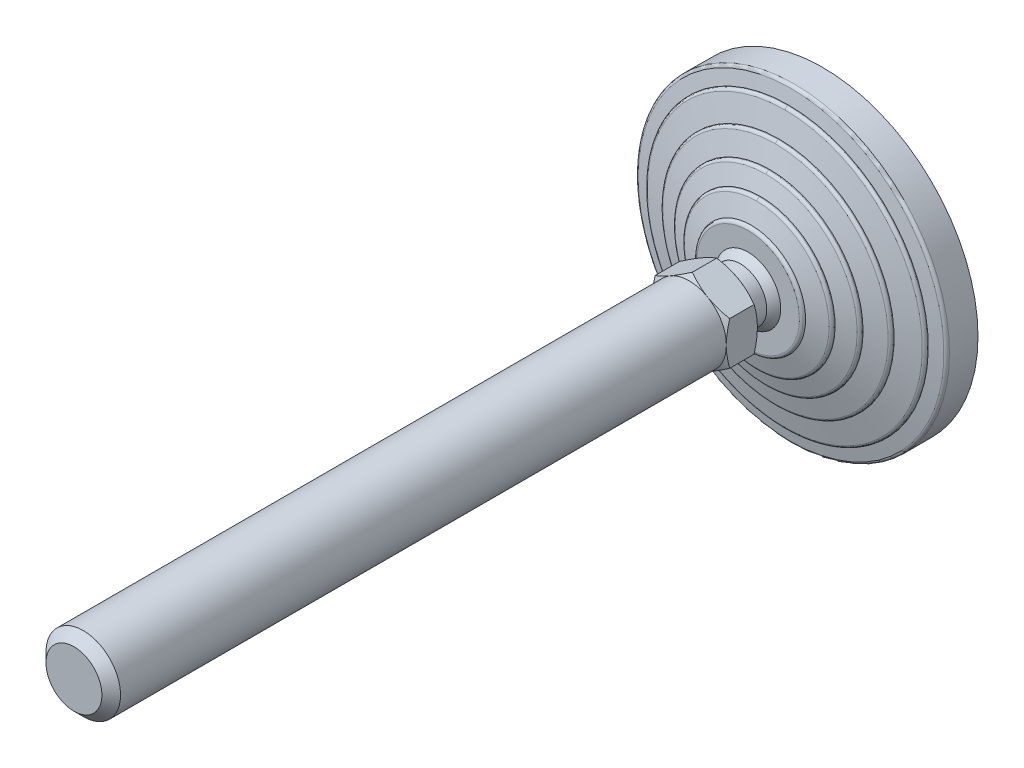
ISO-10303-21;
HEADER;
FILE_DESCRIPTION(('STEP AP214'),'2;1');
FILE_NAME('part.step','',(''),(''),'','','');
FILE_SCHEMA(('AUTOMOTIVE_DESIGN { 1 0 10303 214 1 1 1 1 }'));
ENDSEC;
DATA;
#1=APPLICATION_CONTEXT('core data for automotive mechanical design processes');
#2=APPLICATION_PROTOCOL_DEFINITION('international standard','automotive_design',2000,#1);
#3=PRODUCT_CONTEXT('',#1,'mechanical');
#4=PRODUCT('Part','Part','',(#3));
#5=PRODUCT_RELATED_PRODUCT_CATEGORY('part','',(#4));
#6=PRODUCT_DEFINITION_FORMATION('','',#4);
#7=PRODUCT_DEFINITION_CONTEXT('part definition',#1,'design');
#8=PRODUCT_DEFINITION('design','',#6,#7);
#9=PRODUCT_DEFINITION_SHAPE('','',#8);
#10=(LENGTH_UNIT() NAMED_UNIT(*) SI_UNIT(.MILLI.,.METRE.));
#11=(NAMED_UNIT(*) PLANE_ANGLE_UNIT() SI_UNIT($,.RADIAN.));
#12=(NAMED_UNIT(*) SI_UNIT($,.STERADIAN.) SOLID_ANGLE_UNIT());
#13=UNCERTAINTY_MEASURE_WITH_UNIT(LENGTH_MEASURE(1.E-05),#10,'distance_accuracy_value','');
#14=(GEOMETRIC_REPRESENTATION_CONTEXT(3) GLOBAL_UNCERTAINTY_ASSIGNED_CONTEXT((#13)) GLOBAL_UNIT_ASSIGNED_CONTEXT((#10,
#11,#12)) REPRESENTATION_CONTEXT('',''));
#15=CARTESIAN_POINT('',(0.,0.,0.));
#16=DIRECTION('',(0.,0.,1.));
#17=DIRECTION('',(1.,0.,0.));
#18=AXIS2_PLACEMENT_3D('',#15,#16,#17);
#19=CARTESIAN_POINT('',(-50.774113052,50.6,0.));
#20=DIRECTION('',(0.,0.,1.));
#21=DIRECTION('',(0.,-1.,0.));
#22=AXIS2_PLACEMENT_3D('',#19,#20,#21);
#23=PLANE('',#22);
#24=CARTESIAN_POINT('',(0.,0.,0.));
#25=DIRECTION('',(0.,0.,-1.));
#26=DIRECTION('',(1.,0.,0.));
#27=AXIS2_PLACEMENT_3D('',#24,#25,#26);
#28=CIRCLE('',#27,50.);
#29=CARTESIAN_POINT('',(50.,0.,0.));
#30=VERTEX_POINT('',#29);
#31=EDGE_CURVE('E441',#30,#30,#28,.F.);
#32=ORIENTED_EDGE('',*,*,#31,.F.);
#33=EDGE_LOOP('',(#32));
#34=FACE_BOUND('',#33,.T.);
#35=ADVANCED_FACE('F14',(#34),#23,.F.);
#36=CARTESIAN_POINT('',(0.,0.,9.180196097));
#37=DIRECTION('',(0.,0.,-1.));
#38=DIRECTION('',(1.,0.,0.));
#39=AXIS2_PLACEMENT_3D('',#36,#37,#38);
#40=CYLINDRICAL_SURFACE('',#39,50.);
#41=ORIENTED_EDGE('',*,*,#31,.T.);
#42=EDGE_LOOP('',(#41));
#43=FACE_BOUND('',#42,.T.);
#44=CARTESIAN_POINT('',(0.,0.,9.180196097));
#45=DIRECTION('',(0.,0.,1.));
#46=DIRECTION('',(0.,-1.,0.));
#47=AXIS2_PLACEMENT_3D('',#44,#45,#46);
#48=CIRCLE('',#47,50.);
#49=CARTESIAN_POINT('',(0.,-50.,9.180196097));
#50=VERTEX_POINT('',#49);
#51=EDGE_CURVE('E444',#50,#50,#48,.T.);
#52=ORIENTED_EDGE('',*,*,#51,.F.);
#53=EDGE_LOOP('',(#52));
#54=FACE_BOUND('',#53,.T.);
#55=ADVANCED_FACE('F291',(#43,#54),#40,.T.);
#56=CARTESIAN_POINT('',(0.,0.,9.18019609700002));
#57=DIRECTION('',(0.,0.,-1.));
#58=DIRECTION('',(0.,1.,0.));
#59=AXIS2_PLACEMENT_3D('',#56,#57,#58);
#60=TOROIDAL_SURFACE('',#59,48.9999999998,1.00000000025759);
#61=ORIENTED_EDGE('',*,*,#51,.T.);
#62=EDGE_LOOP('',(#61));
#63=FACE_BOUND('',#62,.T.);
#64=CARTESIAN_POINT('',(0.,0.,10.1607767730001));
#65=DIRECTION('',(0.,0.,-1.));
#66=DIRECTION('',(0.,1.,0.));
#67=AXIS2_PLACEMENT_3D('',#64,#65,#66);
#68=CIRCLE('',#67,49.196116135);
#69=CARTESIAN_POINT('',(0.,49.196116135,10.160776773));
#70=VERTEX_POINT('',#69);
#71=EDGE_CURVE('E445',#70,#70,#68,.F.);
#72=ORIENTED_EDGE('',*,*,#71,.F.);
#73=EDGE_LOOP('',(#72));
#74=FACE_BOUND('',#73,.T.);
#75=ADVANCED_FACE('F287',(#63,#74),#60,.T.);
#76=CARTESIAN_POINT('',(0.,0.,11.));
#77=DIRECTION('',(0.,0.,-1.));
#78=DIRECTION('',(0.,1.,0.));
#79=AXIS2_PLACEMENT_3D('',#76,#77,#78);
#80=CONICAL_SURFACE('',#79,45.,1.37340076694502);
#81=ORIENTED_EDGE('',*,*,#71,.T.);
#82=EDGE_LOOP('',(#81));
#83=FACE_BOUND('',#82,.T.);
#84=CARTESIAN_POINT('',(0.,0.,11.));
#85=DIRECTION('',(0.,0.,-1.));
#86=DIRECTION('',(0.,1.,0.));
#87=AXIS2_PLACEMENT_3D('',#84,#85,#86);
#88=CIRCLE('',#87,45.);
#89=CARTESIAN_POINT('',(0.,45.,11.));
#90=VERTEX_POINT('',#89);
#91=EDGE_CURVE('E448',#90,#90,#88,.F.);
#92=ORIENTED_EDGE('',*,*,#91,.F.);
#93=EDGE_LOOP('',(#92));
#94=FACE_BOUND('',#93,.T.);
#95=ADVANCED_FACE('F290',(#83,#94),#80,.T.);
#96=CARTESIAN_POINT('',(0.,0.,11.219223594));
#97=DIRECTION('',(0.,0.,-1.));
#98=DIRECTION('',(0.,1.,0.));
#99=AXIS2_PLACEMENT_3D('',#96,#97,#98);
#100=CYLINDRICAL_SURFACE('',#99,45.);
#101=ORIENTED_EDGE('',*,*,#91,.T.);
#102=EDGE_LOOP('',(#101));
#103=FACE_BOUND('',#102,.T.);
#104=CARTESIAN_POINT('',(0.,0.,11.219223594));
#105=DIRECTION('',(0.,0.,1.));
#106=DIRECTION('',(0.,-1.,0.));
#107=AXIS2_PLACEMENT_3D('',#104,#105,#106);
#108=CIRCLE('',#107,45.);
#109=CARTESIAN_POINT('',(-4.61482714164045E-09,-45.,11.219223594));
#110=VERTEX_POINT('',#109);
#111=CARTESIAN_POINT('',(0.,45.,11.219223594));
#112=VERTEX_POINT('',#111);
#113=EDGE_CURVE('E650',#110,#112,#108,.T.);
#114=ORIENTED_EDGE('',*,*,#113,.F.);
#115=CARTESIAN_POINT('',(0.,0.,11.219223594));
#116=DIRECTION('',(0.,0.,1.));
#117=DIRECTION('',(0.,-1.,0.));
#118=AXIS2_PLACEMENT_3D('',#115,#116,#117);
#119=CIRCLE('',#118,45.);
#120=EDGE_CURVE('E661',#112,#110,#119,.T.);
#121=ORIENTED_EDGE('',*,*,#120,.F.);
#122=EDGE_LOOP('',(#114,#121));
#123=FACE_BOUND('',#122,.T.);
#124=ADVANCED_FACE('F420',(#103,#123),#100,.T.);
#125=CARTESIAN_POINT('',(0.,-45.,11.219223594));
#126=CARTESIAN_POINT('',(-90.0000000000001,-45.,11.219223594));
#127=CARTESIAN_POINT('',(-90.0000000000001,45.,11.219223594));
#128=CARTESIAN_POINT('',(0.,45.,11.219223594));
#129=CARTESIAN_POINT('',(0.,-45.,11.696951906));
#130=CARTESIAN_POINT('',(-90.0000000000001,-45.,11.696951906));
#131=CARTESIAN_POINT('',(-90.0000000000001,45.,11.696951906));
#132=CARTESIAN_POINT('',(0.,45.,11.696951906));
#133=CARTESIAN_POINT('',(0.,-44.706000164,12.073499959));
#134=CARTESIAN_POINT('',(-89.412000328,-44.706000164,12.073499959));
#135=CARTESIAN_POINT('',(-89.412000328,44.706000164,12.073499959));
#136=CARTESIAN_POINT('',(0.,44.706000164,12.073499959));
#137=CARTESIAN_POINT('',(0.,-44.242535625,12.189366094));
#138=CARTESIAN_POINT('',(-88.4850712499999,-44.2425356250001,12.189366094));
#139=CARTESIAN_POINT('',(-88.4850712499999,44.2425356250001,12.189366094));
#140=CARTESIAN_POINT('',(0.,44.242535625,12.189366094));
#141=(BOUNDED_SURFACE() B_SPLINE_SURFACE(3,3,((#125,#126,#127,#128),(#129,#130,#131,#132),(#133,
#134,#135,#136),(#137,#138,#139,#140)),.UNSPECIFIED.,.F.,.F.,
.F.) B_SPLINE_SURFACE_WITH_KNOTS((4,4),(4,4),(0.,1.),(0.,1.),
.UNSPECIFIED.) GEOMETRIC_REPRESENTATION_ITEM() RATIONAL_B_SPLINE_SURFACE(((1.,0.333333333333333,
0.333333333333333,1.),(0.858803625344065,0.286267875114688,0.286267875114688,0.858803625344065),
(0.858803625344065,0.286267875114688,0.286267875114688,0.858803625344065),(1.,0.333333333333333,
0.333333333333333,1.))) REPRESENTATION_ITEM('') SURFACE());
#142=CARTESIAN_POINT('',(0.,45.,11.219223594));
#143=CARTESIAN_POINT('',(0.,45.,11.696951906));
#144=CARTESIAN_POINT('',(0.,44.706000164,12.073499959));
#145=CARTESIAN_POINT('',(0.,44.242535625,12.189366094));
#146=(BOUNDED_CURVE() B_SPLINE_CURVE(3,(#142,#143,#144,#145),.UNSPECIFIED.,.F.,
.F.) B_SPLINE_CURVE_WITH_KNOTS((4,4),(0.,1.),
.UNSPECIFIED.) CURVE() GEOMETRIC_REPRESENTATION_ITEM() RATIONAL_B_SPLINE_CURVE((1.,
0.858803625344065,0.858803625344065,1.)) REPRESENTATION_ITEM(''));
#147=CARTESIAN_POINT('',(0.,44.242535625,12.189366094));
#148=VERTEX_POINT('',#147);
#149=EDGE_CURVE('E641',#112,#148,#146,.T.);
#150=CARTESIAN_POINT('',(0.,-45.,11.219223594));
#151=CARTESIAN_POINT('',(0.,-45.,11.696951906));
#152=CARTESIAN_POINT('',(0.,-44.706000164,12.073499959));
#153=CARTESIAN_POINT('',(0.,-44.242535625,12.189366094));
#154=(BOUNDED_CURVE() B_SPLINE_CURVE(3,(#150,#151,#152,#153),.UNSPECIFIED.,.F.,
.F.) B_SPLINE_CURVE_WITH_KNOTS((4,4),(0.,1.),
.UNSPECIFIED.) CURVE() GEOMETRIC_REPRESENTATION_ITEM() RATIONAL_B_SPLINE_CURVE((1.,
0.858803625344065,0.858803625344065,1.)) REPRESENTATION_ITEM(''));
#155=CARTESIAN_POINT('',(-1.3611443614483E-08,-44.242535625,12.189366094));
#156=VERTEX_POINT('',#155);
#157=EDGE_CURVE('E655',#156,#110,#154,.F.);
#158=CARTESIAN_POINT('',(0.,0.,12.189366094));
#159=DIRECTION('',(0.,0.,-1.));
#160=DIRECTION('',(0.,1.,0.));
#161=AXIS2_PLACEMENT_3D('',#158,#159,#160);
#162=CIRCLE('',#161,44.242535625);
#163=EDGE_CURVE('E638',#148,#156,#162,.F.);
#164=ORIENTED_EDGE('',*,*,#149,.F.);
#165=ORIENTED_EDGE('',*,*,#120,.T.);
#166=ORIENTED_EDGE('',*,*,#157,.F.);
#167=ORIENTED_EDGE('',*,*,#163,.F.);
#168=EDGE_LOOP('',(#164,#165,#166,#167));
#169=FACE_BOUND('',#168,.T.);
#170=ADVANCED_FACE('F409',(#169),#141,.T.);
#171=CARTESIAN_POINT('',(0.,45.,11.219223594));
#172=CARTESIAN_POINT('',(90.0000000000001,45.,11.219223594));
#173=CARTESIAN_POINT('',(90.0000000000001,-45.,11.219223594));
#174=CARTESIAN_POINT('',(0.,-45.,11.219223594));
#175=CARTESIAN_POINT('',(0.,45.,11.696951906));
#176=CARTESIAN_POINT('',(90.0000000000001,45.,11.696951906));
#177=CARTESIAN_POINT('',(90.0000000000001,-45.,11.696951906));
#178=CARTESIAN_POINT('',(0.,-45.,11.696951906));
#179=CARTESIAN_POINT('',(0.,44.706000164,12.073499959));
#180=CARTESIAN_POINT('',(89.412000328,44.706000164,12.073499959));
#181=CARTESIAN_POINT('',(89.412000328,-44.706000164,12.073499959));
#182=CARTESIAN_POINT('',(0.,-44.706000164,12.073499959));
#183=CARTESIAN_POINT('',(0.,44.242535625,12.189366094));
#184=CARTESIAN_POINT('',(88.4850712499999,44.2425356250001,12.189366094));
#185=CARTESIAN_POINT('',(88.4850712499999,-44.2425356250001,12.189366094));
#186=CARTESIAN_POINT('',(0.,-44.242535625,12.189366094));
#187=(BOUNDED_SURFACE() B_SPLINE_SURFACE(3,3,((#171,#172,#173,#174),(#175,#176,#177,#178),(#179,
#180,#181,#182),(#183,#184,#185,#186)),.UNSPECIFIED.,.F.,.F.,
.F.) B_SPLINE_SURFACE_WITH_KNOTS((4,4),(4,4),(0.,1.),(0.,1.),
.UNSPECIFIED.) GEOMETRIC_REPRESENTATION_ITEM() RATIONAL_B_SPLINE_SURFACE(((1.,0.333333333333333,
0.333333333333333,1.),(0.858803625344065,0.286267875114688,0.286267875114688,0.858803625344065),
(0.858803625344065,0.286267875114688,0.286267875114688,0.858803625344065),(1.,0.333333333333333,
0.333333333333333,1.))) REPRESENTATION_ITEM('') SURFACE());
#188=CARTESIAN_POINT('',(0.,0.,12.189366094));
#189=DIRECTION('',(0.,0.,-1.));
#190=DIRECTION('',(0.,1.,0.));
#191=AXIS2_PLACEMENT_3D('',#188,#189,#190);
#192=CIRCLE('',#191,44.242535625);
#193=EDGE_CURVE('E637',#156,#148,#192,.F.);
#194=ORIENTED_EDGE('',*,*,#113,.T.);
#195=ORIENTED_EDGE('',*,*,#149,.T.);
#196=ORIENTED_EDGE('',*,*,#193,.F.);
#197=ORIENTED_EDGE('',*,*,#157,.T.);
#198=EDGE_LOOP('',(#194,#195,#196,#197));
#199=FACE_BOUND('',#198,.T.);
#200=ADVANCED_FACE('F403',(#199),#187,.T.);
#201=CARTESIAN_POINT('',(0.,0.,14.));
#202=DIRECTION('',(0.,0.,-1.));
#203=DIRECTION('',(1.,0.,0.));
#204=AXIS2_PLACEMENT_3D('',#201,#202,#203);
#205=CONICAL_SURFACE('',#204,37.,1.32581766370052);
#206=ORIENTED_EDGE('',*,*,#163,.T.);
#207=ORIENTED_EDGE('',*,*,#193,.T.);
#208=EDGE_LOOP('',(#206,#207));
#209=FACE_BOUND('',#208,.T.);
#210=CARTESIAN_POINT('',(0.,0.,14.));
#211=DIRECTION('',(0.,0.,-1.));
#212=DIRECTION('',(0.,1.,0.));
#213=AXIS2_PLACEMENT_3D('',#210,#211,#212);
#214=CIRCLE('',#213,37.);
#215=CARTESIAN_POINT('',(0.,37.,14.));
#216=VERTEX_POINT('',#215);
#217=EDGE_CURVE('E628',#216,#216,#214,.F.);
#218=ORIENTED_EDGE('',*,*,#217,.F.);
#219=EDGE_LOOP('',(#218));
#220=FACE_BOUND('',#219,.T.);
#221=ADVANCED_FACE('F399',(#209,#220),#205,.T.);
#222=CARTESIAN_POINT('',(0.,0.,14.245698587));
#223=DIRECTION('',(0.,0.,-1.));
#224=DIRECTION('',(1.,0.,0.));
#225=AXIS2_PLACEMENT_3D('',#222,#223,#224);
#226=CYLINDRICAL_SURFACE('',#225,37.);
#227=ORIENTED_EDGE('',*,*,#217,.T.);
#228=EDGE_LOOP('',(#227));
#229=FACE_BOUND('',#228,.T.);
#230=CARTESIAN_POINT('',(0.,0.,14.245698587));
#231=DIRECTION('',(0.,0.,1.));
#232=DIRECTION('',(0.,-1.,0.));
#233=AXIS2_PLACEMENT_3D('',#230,#231,#232);
#234=CIRCLE('',#233,37.);
#235=CARTESIAN_POINT('',(-3.79441342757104E-09,-37.,14.245698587));
#236=VERTEX_POINT('',#235);
#237=CARTESIAN_POINT('',(0.,37.,14.245698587));
#238=VERTEX_POINT('',#237);
#239=EDGE_CURVE('E608',#236,#238,#234,.T.);
#240=ORIENTED_EDGE('',*,*,#239,.F.);
#241=CARTESIAN_POINT('',(0.,0.,14.245698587));
#242=DIRECTION('',(0.,0.,1.));
#243=DIRECTION('',(0.,-1.,0.));
#244=AXIS2_PLACEMENT_3D('',#241,#242,#243);
#245=CIRCLE('',#244,37.);
#246=EDGE_CURVE('E619',#238,#236,#245,.T.);
#247=ORIENTED_EDGE('',*,*,#246,.F.);
#248=EDGE_LOOP('',(#240,#247));
#249=FACE_BOUND('',#248,.T.);
#250=ADVANCED_FACE('F390',(#229,#249),#226,.T.);
#251=CARTESIAN_POINT('',(0.,-37.,14.245698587));
#252=CARTESIAN_POINT('',(-74.,-37.,14.245698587));
#253=CARTESIAN_POINT('',(-74.,37.,14.245698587));
#254=CARTESIAN_POINT('',(0.,37.,14.245698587));
#255=CARTESIAN_POINT('',(0.,-37.,14.709515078));
#256=CARTESIAN_POINT('',(-73.9999999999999,-37.,14.709515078));
#257=CARTESIAN_POINT('',(-73.9999999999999,37.,14.709515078));
#258=CARTESIAN_POINT('',(0.,37.,14.709515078));
#259=CARTESIAN_POINT('',(0.,-36.720691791,15.079802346));
#260=CARTESIAN_POINT('',(-73.4413835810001,-36.720691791,15.079802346));
#261=CARTESIAN_POINT('',(-73.4413835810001,36.720691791,15.079802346));
#262=CARTESIAN_POINT('',(0.,36.720691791,15.079802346));
#263=CARTESIAN_POINT('',(0.,-36.274721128,15.207222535));
#264=CARTESIAN_POINT('',(-72.549442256,-36.274721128,15.207222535));
#265=CARTESIAN_POINT('',(-72.549442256,36.274721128,15.207222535));
#266=CARTESIAN_POINT('',(0.,36.274721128,15.207222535));
#267=(BOUNDED_SURFACE() B_SPLINE_SURFACE(3,3,((#251,#252,#253,#254),(#255,#256,#257,#258),(#259,
#260,#261,#262),(#263,#264,#265,#266)),.UNSPECIFIED.,.F.,.F.,
.F.) B_SPLINE_SURFACE_WITH_KNOTS((4,4),(4,4),(0.,1.),(0.,1.),
.UNSPECIFIED.) GEOMETRIC_REPRESENTATION_ITEM() RATIONAL_B_SPLINE_SURFACE(((1.,0.333333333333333,
0.333333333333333,1.),(0.865565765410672,0.288521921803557,0.288521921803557,0.865565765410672),
(0.865565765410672,0.288521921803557,0.288521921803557,0.865565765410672),(1.,0.333333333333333,
0.333333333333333,1.))) REPRESENTATION_ITEM('') SURFACE());
#268=CARTESIAN_POINT('',(0.,37.,14.245698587));
#269=CARTESIAN_POINT('',(0.,37.,14.709515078));
#270=CARTESIAN_POINT('',(0.,36.720691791,15.079802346));
#271=CARTESIAN_POINT('',(0.,36.274721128,15.207222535));
#272=(BOUNDED_CURVE() B_SPLINE_CURVE(3,(#268,#269,#270,#271),.UNSPECIFIED.,.F.,
.F.) B_SPLINE_CURVE_WITH_KNOTS((4,4),(0.,1.),
.UNSPECIFIED.) CURVE() GEOMETRIC_REPRESENTATION_ITEM() RATIONAL_B_SPLINE_CURVE((1.,
0.865565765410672,0.865565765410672,1.)) REPRESENTATION_ITEM(''));
#273=CARTESIAN_POINT('',(0.,36.274721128,15.2072225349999));
#274=VERTEX_POINT('',#273);
#275=EDGE_CURVE('E599',#238,#274,#272,.T.);
#276=CARTESIAN_POINT('',(0.,-37.,14.245698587));
#277=CARTESIAN_POINT('',(0.,-37.,14.709515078));
#278=CARTESIAN_POINT('',(0.,-36.720691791,15.079802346));
#279=CARTESIAN_POINT('',(0.,-36.274721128,15.207222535));
#280=(BOUNDED_CURVE() B_SPLINE_CURVE(3,(#276,#277,#278,#279),.UNSPECIFIED.,.F.,
.F.) B_SPLINE_CURVE_WITH_KNOTS((4,4),(0.,1.),
.UNSPECIFIED.) CURVE() GEOMETRIC_REPRESENTATION_ITEM() RATIONAL_B_SPLINE_CURVE((1.,
0.865565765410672,0.865565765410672,1.)) REPRESENTATION_ITEM(''));
#281=CARTESIAN_POINT('',(-1.11601045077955E-08,-36.274721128,15.2072225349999));
#282=VERTEX_POINT('',#281);
#283=EDGE_CURVE('E613',#282,#236,#280,.F.);
#284=CARTESIAN_POINT('',(0.,0.,15.2072225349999));
#285=DIRECTION('',(0.,0.,-1.));
#286=DIRECTION('',(0.,1.,0.));
#287=AXIS2_PLACEMENT_3D('',#284,#285,#286);
#288=CIRCLE('',#287,36.274721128);
#289=EDGE_CURVE('E596',#274,#282,#288,.F.);
#290=ORIENTED_EDGE('',*,*,#275,.F.);
#291=ORIENTED_EDGE('',*,*,#246,.T.);
#292=ORIENTED_EDGE('',*,*,#283,.F.);
#293=ORIENTED_EDGE('',*,*,#289,.F.);
#294=EDGE_LOOP('',(#290,#291,#292,#293));
#295=FACE_BOUND('',#294,.T.);
#296=ADVANCED_FACE('F379',(#295),#267,.T.);
#297=CARTESIAN_POINT('',(0.,37.,14.245698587));
#298=CARTESIAN_POINT('',(74.,37.,14.245698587));
#299=CARTESIAN_POINT('',(74.,-37.,14.245698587));
#300=CARTESIAN_POINT('',(0.,-37.,14.245698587));
#301=CARTESIAN_POINT('',(0.,37.,14.709515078));
#302=CARTESIAN_POINT('',(73.9999999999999,37.,14.709515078));
#303=CARTESIAN_POINT('',(73.9999999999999,-37.,14.709515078));
#304=CARTESIAN_POINT('',(0.,-37.,14.709515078));
#305=CARTESIAN_POINT('',(0.,36.720691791,15.079802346));
#306=CARTESIAN_POINT('',(73.4413835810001,36.720691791,15.079802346));
#307=CARTESIAN_POINT('',(73.4413835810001,-36.720691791,15.079802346));
#308=CARTESIAN_POINT('',(0.,-36.720691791,15.079802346));
#309=CARTESIAN_POINT('',(0.,36.274721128,15.207222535));
#310=CARTESIAN_POINT('',(72.549442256,36.274721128,15.207222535));
#311=CARTESIAN_POINT('',(72.549442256,-36.274721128,15.207222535));
#312=CARTESIAN_POINT('',(0.,-36.274721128,15.207222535));
#313=(BOUNDED_SURFACE() B_SPLINE_SURFACE(3,3,((#297,#298,#299,#300),(#301,#302,#303,#304),(#305,
#306,#307,#308),(#309,#310,#311,#312)),.UNSPECIFIED.,.F.,.F.,
.F.) B_SPLINE_SURFACE_WITH_KNOTS((4,4),(4,4),(0.,1.),(0.,1.),
.UNSPECIFIED.) GEOMETRIC_REPRESENTATION_ITEM() RATIONAL_B_SPLINE_SURFACE(((1.,0.333333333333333,
0.333333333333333,1.),(0.865565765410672,0.288521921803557,0.288521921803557,0.865565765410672),
(0.865565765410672,0.288521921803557,0.288521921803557,0.865565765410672),(1.,0.333333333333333,
0.333333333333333,1.))) REPRESENTATION_ITEM('') SURFACE());
#314=CARTESIAN_POINT('',(0.,0.,15.2072225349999));
#315=DIRECTION('',(0.,0.,-1.));
#316=DIRECTION('',(0.,1.,0.));
#317=AXIS2_PLACEMENT_3D('',#314,#315,#316);
#318=CIRCLE('',#317,36.274721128);
#319=EDGE_CURVE('E595',#282,#274,#318,.F.);
#320=ORIENTED_EDGE('',*,*,#239,.T.);
#321=ORIENTED_EDGE('',*,*,#275,.T.);
#322=ORIENTED_EDGE('',*,*,#319,.F.);
#323=ORIENTED_EDGE('',*,*,#283,.T.);
#324=EDGE_LOOP('',(#320,#321,#322,#323));
#325=FACE_BOUND('',#324,.T.);
#326=ADVANCED_FACE('F373',(#325),#313,.T.);
#327=CARTESIAN_POINT('',(0.,0.,17.));
#328=DIRECTION('',(0.,0.,-1.));
#329=DIRECTION('',(0.,1.,0.));
#330=AXIS2_PLACEMENT_3D('',#327,#328,#329);
#331=CONICAL_SURFACE('',#330,30.,1.29249666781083);
#332=ORIENTED_EDGE('',*,*,#289,.T.);
#333=ORIENTED_EDGE('',*,*,#319,.T.);
#334=EDGE_LOOP('',(#332,#333));
#335=FACE_BOUND('',#334,.T.);
#336=CARTESIAN_POINT('',(0.,0.,17.));
#337=DIRECTION('',(0.,0.,-1.));
#338=DIRECTION('',(0.,1.,0.));
#339=AXIS2_PLACEMENT_3D('',#336,#337,#338);
#340=CIRCLE('',#339,30.);
#341=CARTESIAN_POINT('',(0.,30.,17.));
#342=VERTEX_POINT('',#341);
#343=EDGE_CURVE('E586',#342,#342,#340,.F.);
#344=ORIENTED_EDGE('',*,*,#343,.F.);
#345=EDGE_LOOP('',(#344));
#346=FACE_BOUND('',#345,.T.);
#347=ADVANCED_FACE('F369',(#335,#346),#331,.T.);
#348=CARTESIAN_POINT('',(0.,0.,17.27924078));
#349=DIRECTION('',(0.,0.,-1.));
#350=DIRECTION('',(0.,1.,0.));
#351=AXIS2_PLACEMENT_3D('',#348,#349,#350);
#352=CYLINDRICAL_SURFACE('',#351,30.);
#353=ORIENTED_EDGE('',*,*,#343,.T.);
#354=EDGE_LOOP('',(#353));
#355=FACE_BOUND('',#354,.T.);
#356=CARTESIAN_POINT('',(0.,0.,17.27924078));
#357=DIRECTION('',(0.,0.,1.));
#358=DIRECTION('',(0.,-1.,0.));
#359=AXIS2_PLACEMENT_3D('',#356,#357,#358);
#360=CIRCLE('',#359,30.);
#361=CARTESIAN_POINT('',(-3.0765514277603E-09,-30.,17.27924078));
#362=VERTEX_POINT('',#361);
#363=CARTESIAN_POINT('',(0.,30.,17.27924078));
#364=VERTEX_POINT('',#363);
#365=EDGE_CURVE('E566',#362,#364,#360,.T.);
#366=ORIENTED_EDGE('',*,*,#365,.F.);
#367=CARTESIAN_POINT('',(0.,0.,17.27924078));
#368=DIRECTION('',(0.,0.,1.));
#369=DIRECTION('',(0.,-1.,0.));
#370=AXIS2_PLACEMENT_3D('',#367,#368,#369);
#371=CIRCLE('',#370,30.);
#372=EDGE_CURVE('E577',#364,#362,#371,.T.);
#373=ORIENTED_EDGE('',*,*,#372,.F.);
#374=EDGE_LOOP('',(#366,#373));
#375=FACE_BOUND('',#374,.T.);
#376=ADVANCED_FACE('F360',(#355,#375),#352,.T.);
#377=CARTESIAN_POINT('',(0.,-30.,17.27924078));
#378=CARTESIAN_POINT('',(-60.0000000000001,-30.,17.27924078));
#379=CARTESIAN_POINT('',(-60.0000000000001,30.,17.27924078));
#380=CARTESIAN_POINT('',(0.,30.,17.27924078));
#381=CARTESIAN_POINT('',(0.,-30.,17.725161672));
#382=CARTESIAN_POINT('',(-60.,-30.,17.725161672));
#383=CARTESIAN_POINT('',(-60.,30.,17.725161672));
#384=CARTESIAN_POINT('',(0.,30.,17.725161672));
#385=CARTESIAN_POINT('',(0.,-29.739265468,18.086911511));
#386=CARTESIAN_POINT('',(-59.4785309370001,-29.739265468,18.086911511));
#387=CARTESIAN_POINT('',(-59.4785309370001,29.739265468,18.086911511));
#388=CARTESIAN_POINT('',(0.,29.739265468,18.086911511));
#389=CARTESIAN_POINT('',(0.,-29.316227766,18.227924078));
#390=CARTESIAN_POINT('',(-58.6324555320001,-29.316227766,18.227924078));
#391=CARTESIAN_POINT('',(-58.6324555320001,29.316227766,18.227924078));
#392=CARTESIAN_POINT('',(0.,29.316227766,18.227924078));
#393=(BOUNDED_SURFACE() B_SPLINE_SURFACE(3,3,((#377,#378,#379,#380),(#381,#382,#383,#384),(#385,
#386,#387,#388),(#389,#390,#391,#392)),.UNSPECIFIED.,.F.,.F.,
.F.) B_SPLINE_SURFACE_WITH_KNOTS((4,4),(4,4),(0.,1.),(0.,1.),
.UNSPECIFIED.) GEOMETRIC_REPRESENTATION_ITEM() RATIONAL_B_SPLINE_SURFACE(((1.,0.333333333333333,
0.333333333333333,1.),(0.874161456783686,0.291387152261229,0.291387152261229,0.874161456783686),
(0.874161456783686,0.291387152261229,0.291387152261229,0.874161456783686),(1.,0.333333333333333,
0.333333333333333,1.))) REPRESENTATION_ITEM('') SURFACE());
#394=CARTESIAN_POINT('',(0.,30.,17.27924078));
#395=CARTESIAN_POINT('',(0.,30.,17.725161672));
#396=CARTESIAN_POINT('',(0.,29.739265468,18.086911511));
#397=CARTESIAN_POINT('',(0.,29.316227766,18.227924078));
#398=(BOUNDED_CURVE() B_SPLINE_CURVE(3,(#394,#395,#396,#397),.UNSPECIFIED.,.F.,
.F.) B_SPLINE_CURVE_WITH_KNOTS((4,4),(0.,1.),
.UNSPECIFIED.) CURVE() GEOMETRIC_REPRESENTATION_ITEM() RATIONAL_B_SPLINE_CURVE((1.,
0.874161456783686,0.874161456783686,1.)) REPRESENTATION_ITEM(''));
#399=CARTESIAN_POINT('',(0.,29.3162277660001,18.2279240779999));
#400=VERTEX_POINT('',#399);
#401=EDGE_CURVE('E557',#364,#400,#398,.T.);
#402=CARTESIAN_POINT('',(0.,-30.,17.27924078));
#403=CARTESIAN_POINT('',(0.,-30.,17.725161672));
#404=CARTESIAN_POINT('',(0.,-29.739265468,18.086911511));
#405=CARTESIAN_POINT('',(0.,-29.316227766,18.227924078));
#406=(BOUNDED_CURVE() B_SPLINE_CURVE(3,(#402,#403,#404,#405),.UNSPECIFIED.,.F.,
.F.) B_SPLINE_CURVE_WITH_KNOTS((4,4),(0.,1.),
.UNSPECIFIED.) CURVE() GEOMETRIC_REPRESENTATION_ITEM() RATIONAL_B_SPLINE_CURVE((1.,
0.874161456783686,0.874161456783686,1.)) REPRESENTATION_ITEM(''));
#407=CARTESIAN_POINT('',(-9.01928823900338E-09,-29.3162277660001,18.2279240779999));
#408=VERTEX_POINT('',#407);
#409=EDGE_CURVE('E571',#408,#362,#406,.F.);
#410=CARTESIAN_POINT('',(0.,0.,18.2279240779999));
#411=DIRECTION('',(0.,0.,-1.));
#412=DIRECTION('',(0.,1.,0.));
#413=AXIS2_PLACEMENT_3D('',#410,#411,#412);
#414=CIRCLE('',#413,29.316227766);
#415=EDGE_CURVE('E554',#400,#408,#414,.F.);
#416=ORIENTED_EDGE('',*,*,#401,.F.);
#417=ORIENTED_EDGE('',*,*,#372,.T.);
#418=ORIENTED_EDGE('',*,*,#409,.F.);
#419=ORIENTED_EDGE('',*,*,#415,.F.);
#420=EDGE_LOOP('',(#416,#417,#418,#419));
#421=FACE_BOUND('',#420,.T.);
#422=ADVANCED_FACE('F349',(#421),#393,.T.);
#423=CARTESIAN_POINT('',(0.,30.,17.27924078));
#424=CARTESIAN_POINT('',(60.0000000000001,30.,17.27924078));
#425=CARTESIAN_POINT('',(60.0000000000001,-30.,17.27924078));
#426=CARTESIAN_POINT('',(0.,-30.,17.27924078));
#427=CARTESIAN_POINT('',(0.,30.,17.725161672));
#428=CARTESIAN_POINT('',(60.,30.,17.725161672));
#429=CARTESIAN_POINT('',(60.,-30.,17.725161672));
#430=CARTESIAN_POINT('',(0.,-30.,17.725161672));
#431=CARTESIAN_POINT('',(0.,29.739265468,18.086911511));
#432=CARTESIAN_POINT('',(59.4785309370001,29.739265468,18.086911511));
#433=CARTESIAN_POINT('',(59.4785309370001,-29.739265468,18.086911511));
#434=CARTESIAN_POINT('',(0.,-29.739265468,18.086911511));
#435=CARTESIAN_POINT('',(0.,29.316227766,18.227924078));
#436=CARTESIAN_POINT('',(58.6324555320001,29.316227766,18.227924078));
#437=CARTESIAN_POINT('',(58.6324555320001,-29.316227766,18.227924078));
#438=CARTESIAN_POINT('',(0.,-29.316227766,18.227924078));
#439=(BOUNDED_SURFACE() B_SPLINE_SURFACE(3,3,((#423,#424,#425,#426),(#427,#428,#429,#430),(#431,
#432,#433,#434),(#435,#436,#437,#438)),.UNSPECIFIED.,.F.,.F.,
.F.) B_SPLINE_SURFACE_WITH_KNOTS((4,4),(4,4),(0.,1.),(0.,1.),
.UNSPECIFIED.) GEOMETRIC_REPRESENTATION_ITEM() RATIONAL_B_SPLINE_SURFACE(((1.,0.333333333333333,
0.333333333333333,1.),(0.874161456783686,0.291387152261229,0.291387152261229,0.874161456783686),
(0.874161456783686,0.291387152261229,0.291387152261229,0.874161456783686),(1.,0.333333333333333,
0.333333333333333,1.))) REPRESENTATION_ITEM('') SURFACE());
#440=CARTESIAN_POINT('',(0.,0.,18.2279240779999));
#441=DIRECTION('',(0.,0.,-1.));
#442=DIRECTION('',(0.,1.,0.));
#443=AXIS2_PLACEMENT_3D('',#440,#441,#442);
#444=CIRCLE('',#443,29.316227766);
#445=EDGE_CURVE('E553',#408,#400,#444,.F.);
#446=ORIENTED_EDGE('',*,*,#365,.T.);
#447=ORIENTED_EDGE('',*,*,#401,.T.);
#448=ORIENTED_EDGE('',*,*,#445,.F.);
#449=ORIENTED_EDGE('',*,*,#409,.T.);
#450=EDGE_LOOP('',(#446,#447,#448,#449));
#451=FACE_BOUND('',#450,.T.);
#452=ADVANCED_FACE('F343',(#451),#439,.T.);
#453=CARTESIAN_POINT('',(0.,0.,20.));
#454=DIRECTION('',(0.,0.,-1.));
#455=DIRECTION('',(1.,0.,0.));
#456=AXIS2_PLACEMENT_3D('',#453,#454,#455);
#457=CONICAL_SURFACE('',#456,24.,1.24904577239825);
#458=ORIENTED_EDGE('',*,*,#415,.T.);
#459=ORIENTED_EDGE('',*,*,#445,.T.);
#460=EDGE_LOOP('',(#458,#459));
#461=FACE_BOUND('',#460,.T.);
#462=CARTESIAN_POINT('',(0.,0.,20.));
#463=DIRECTION('',(0.,0.,-1.));
#464=DIRECTION('',(0.,1.,0.));
#465=AXIS2_PLACEMENT_3D('',#462,#463,#464);
#466=CIRCLE('',#465,24.);
#467=CARTESIAN_POINT('',(0.,24.,20.));
#468=VERTEX_POINT('',#467);
#469=EDGE_CURVE('E544',#468,#468,#466,.F.);
#470=ORIENTED_EDGE('',*,*,#469,.F.);
#471=EDGE_LOOP('',(#470));
#472=FACE_BOUND('',#471,.T.);
#473=ADVANCED_FACE('F339',(#461,#472),#457,.T.);
#474=CARTESIAN_POINT('',(0.,0.,20.261425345));
#475=DIRECTION('',(0.,0.,-1.));
#476=DIRECTION('',(0.,1.,0.));
#477=AXIS2_PLACEMENT_3D('',#474,#475,#476);
#478=CYLINDRICAL_SURFACE('',#477,24.);
#479=ORIENTED_EDGE('',*,*,#469,.T.);
#480=EDGE_LOOP('',(#479));
#481=FACE_BOUND('',#480,.T.);
#482=CARTESIAN_POINT('',(0.,0.,20.261425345));
#483=DIRECTION('',(0.,0.,1.));
#484=DIRECTION('',(0.,-1.,0.));
#485=AXIS2_PLACEMENT_3D('',#482,#483,#484);
#486=CIRCLE('',#485,24.);
#487=CARTESIAN_POINT('',(-2.46124114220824E-09,-24.,20.261425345));
#488=VERTEX_POINT('',#487);
#489=CARTESIAN_POINT('',(0.,24.,20.261425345));
#490=VERTEX_POINT('',#489);
#491=EDGE_CURVE('E524',#488,#490,#486,.T.);
#492=ORIENTED_EDGE('',*,*,#491,.F.);
#493=CARTESIAN_POINT('',(0.,0.,20.261425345));
#494=DIRECTION('',(0.,0.,1.));
#495=DIRECTION('',(0.,-1.,0.));
#496=AXIS2_PLACEMENT_3D('',#493,#494,#495);
#497=CIRCLE('',#496,24.);
#498=EDGE_CURVE('E535',#490,#488,#497,.T.);
#499=ORIENTED_EDGE('',*,*,#498,.F.);
#500=EDGE_LOOP('',(#492,#499));
#501=FACE_BOUND('',#500,.T.);
#502=ADVANCED_FACE('F330',(#481,#501),#478,.T.);
#503=CARTESIAN_POINT('',(0.,-24.,20.261425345));
#504=CARTESIAN_POINT('',(-48.,-24.,20.261425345));
#505=CARTESIAN_POINT('',(-48.,24.,20.261425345));
#506=CARTESIAN_POINT('',(0.,24.,20.261425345));
#507=CARTESIAN_POINT('',(0.,-24.,20.716888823));
#508=CARTESIAN_POINT('',(-48.,-24.,20.716888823));
#509=CARTESIAN_POINT('',(-48.,24.,20.716888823));
#510=CARTESIAN_POINT('',(0.,24.,20.716888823));
#511=CARTESIAN_POINT('',(0.,-23.72940828,21.083258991));
#512=CARTESIAN_POINT('',(-47.458816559,-23.72940828,21.083258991));
#513=CARTESIAN_POINT('',(-47.458816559,23.72940828,21.083258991));
#514=CARTESIAN_POINT('',(0.,23.72940828,21.083258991));
#515=CARTESIAN_POINT('',(0.,-23.294085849,21.217204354));
#516=CARTESIAN_POINT('',(-46.5881716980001,-23.294085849,21.217204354));
#517=CARTESIAN_POINT('',(-46.5881716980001,23.294085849,21.217204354));
#518=CARTESIAN_POINT('',(0.,23.294085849,21.217204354));
#519=(BOUNDED_SURFACE() B_SPLINE_SURFACE(3,3,((#503,#504,#505,#506),(#507,#508,#509,#510),(#511,
#512,#513,#514),(#515,#516,#517,#518)),.UNSPECIFIED.,.F.,.F.,
.F.) B_SPLINE_SURFACE_WITH_KNOTS((4,4),(4,4),(0.,1.),(0.,1.),
.UNSPECIFIED.) GEOMETRIC_REPRESENTATION_ITEM() RATIONAL_B_SPLINE_SURFACE(((1.,0.333333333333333,
0.333333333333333,1.),(0.869593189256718,0.289864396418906,0.289864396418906,0.869593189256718),
(0.869593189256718,0.289864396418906,0.289864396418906,0.869593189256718),(1.,0.333333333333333,
0.333333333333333,1.))) REPRESENTATION_ITEM('') SURFACE());
#520=CARTESIAN_POINT('',(0.,24.,20.261425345));
#521=CARTESIAN_POINT('',(0.,24.,20.716888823));
#522=CARTESIAN_POINT('',(0.,23.72940828,21.083258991));
#523=CARTESIAN_POINT('',(0.,23.294085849,21.217204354));
#524=(BOUNDED_CURVE() B_SPLINE_CURVE(3,(#520,#521,#522,#523),.UNSPECIFIED.,.F.,
.F.) B_SPLINE_CURVE_WITH_KNOTS((4,4),(0.,1.),
.UNSPECIFIED.) CURVE() GEOMETRIC_REPRESENTATION_ITEM() RATIONAL_B_SPLINE_CURVE((1.,
0.869593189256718,0.869593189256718,1.)) REPRESENTATION_ITEM(''));
#525=CARTESIAN_POINT('',(0.,23.294085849,21.217204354));
#526=VERTEX_POINT('',#525);
#527=EDGE_CURVE('E515',#490,#526,#524,.T.);
#528=CARTESIAN_POINT('',(0.,-24.,20.261425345));
#529=CARTESIAN_POINT('',(0.,-24.,20.716888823));
#530=CARTESIAN_POINT('',(0.,-23.72940828,21.083258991));
#531=CARTESIAN_POINT('',(0.,-23.294085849,21.217204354));
#532=(BOUNDED_CURVE() B_SPLINE_CURVE(3,(#528,#529,#530,#531),.UNSPECIFIED.,.F.,
.F.) B_SPLINE_CURVE_WITH_KNOTS((4,4),(0.,1.),
.UNSPECIFIED.) CURVE() GEOMETRIC_REPRESENTATION_ITEM() RATIONAL_B_SPLINE_CURVE((1.,
0.869593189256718,0.869593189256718,1.)) REPRESENTATION_ITEM(''));
#533=CARTESIAN_POINT('',(-7.1665453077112E-09,-23.294085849,21.217204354));
#534=VERTEX_POINT('',#533);
#535=EDGE_CURVE('E529',#534,#488,#532,.F.);
#536=CARTESIAN_POINT('',(0.,0.,21.217204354));
#537=DIRECTION('',(0.,0.,-1.));
#538=DIRECTION('',(0.,1.,0.));
#539=AXIS2_PLACEMENT_3D('',#536,#537,#538);
#540=CIRCLE('',#539,23.294085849);
#541=EDGE_CURVE('E512',#526,#534,#540,.F.);
#542=ORIENTED_EDGE('',*,*,#527,.F.);
#543=ORIENTED_EDGE('',*,*,#498,.T.);
#544=ORIENTED_EDGE('',*,*,#535,.F.);
#545=ORIENTED_EDGE('',*,*,#541,.F.);
#546=EDGE_LOOP('',(#542,#543,#544,#545));
#547=FACE_BOUND('',#546,.T.);
#548=ADVANCED_FACE('F319',(#547),#519,.T.);
#549=CARTESIAN_POINT('',(0.,24.,20.261425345));
#550=CARTESIAN_POINT('',(48.,24.,20.261425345));
#551=CARTESIAN_POINT('',(48.,-24.,20.261425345));
#552=CARTESIAN_POINT('',(0.,-24.,20.261425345));
#553=CARTESIAN_POINT('',(0.,24.,20.716888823));
#554=CARTESIAN_POINT('',(48.,24.,20.716888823));
#555=CARTESIAN_POINT('',(48.,-24.,20.716888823));
#556=CARTESIAN_POINT('',(0.,-24.,20.716888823));
#557=CARTESIAN_POINT('',(0.,23.72940828,21.083258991));
#558=CARTESIAN_POINT('',(47.458816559,23.72940828,21.083258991));
#559=CARTESIAN_POINT('',(47.458816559,-23.72940828,21.083258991));
#560=CARTESIAN_POINT('',(0.,-23.72940828,21.083258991));
#561=CARTESIAN_POINT('',(0.,23.294085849,21.217204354));
#562=CARTESIAN_POINT('',(46.5881716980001,23.294085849,21.217204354));
#563=CARTESIAN_POINT('',(46.5881716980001,-23.294085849,21.217204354));
#564=CARTESIAN_POINT('',(0.,-23.294085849,21.217204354));
#565=(BOUNDED_SURFACE() B_SPLINE_SURFACE(3,3,((#549,#550,#551,#552),(#553,#554,#555,#556),(#557,
#558,#559,#560),(#561,#562,#563,#564)),.UNSPECIFIED.,.F.,.F.,
.F.) B_SPLINE_SURFACE_WITH_KNOTS((4,4),(4,4),(0.,1.),(0.,1.),
.UNSPECIFIED.) GEOMETRIC_REPRESENTATION_ITEM() RATIONAL_B_SPLINE_SURFACE(((1.,0.333333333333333,
0.333333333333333,1.),(0.869593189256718,0.289864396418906,0.289864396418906,0.869593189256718),
(0.869593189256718,0.289864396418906,0.289864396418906,0.869593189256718),(1.,0.333333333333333,
0.333333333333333,1.))) REPRESENTATION_ITEM('') SURFACE());
#566=CARTESIAN_POINT('',(0.,0.,21.217204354));
#567=DIRECTION('',(0.,0.,-1.));
#568=DIRECTION('',(0.,1.,0.));
#569=AXIS2_PLACEMENT_3D('',#566,#567,#568);
#570=CIRCLE('',#569,23.294085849);
#571=EDGE_CURVE('E511',#534,#526,#570,.F.);
#572=ORIENTED_EDGE('',*,*,#491,.T.);
#573=ORIENTED_EDGE('',*,*,#527,.T.);
#574=ORIENTED_EDGE('',*,*,#571,.F.);
#575=ORIENTED_EDGE('',*,*,#535,.T.);
#576=EDGE_LOOP('',(#572,#573,#574,#575));
#577=FACE_BOUND('',#576,.T.);
#578=ADVANCED_FACE('F313',(#577),#565,.T.);
#579=CARTESIAN_POINT('',(0.,0.,23.));
#580=DIRECTION('',(0.,0.,-1.));
#581=DIRECTION('',(0.,1.,0.));
#582=AXIS2_PLACEMENT_3D('',#579,#580,#581);
#583=CONICAL_SURFACE('',#582,17.5,1.27229739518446);
#584=ORIENTED_EDGE('',*,*,#541,.T.);
#585=ORIENTED_EDGE('',*,*,#571,.T.);
#586=EDGE_LOOP('',(#584,#585));
#587=FACE_BOUND('',#586,.T.);
#588=CARTESIAN_POINT('',(0.,0.,23.));
#589=DIRECTION('',(0.,0.,1.));
#590=DIRECTION('',(0.,-1.,0.));
#591=AXIS2_PLACEMENT_3D('',#588,#589,#590);
#592=CIRCLE('',#591,17.5);
#593=CARTESIAN_POINT('',(0.,-17.5,23.));
#594=VERTEX_POINT('',#593);
#595=EDGE_CURVE('E482',#594,#594,#592,.T.);
#596=ORIENTED_EDGE('',*,*,#595,.F.);
#597=EDGE_LOOP('',(#596));
#598=FACE_BOUND('',#597,.T.);
#599=ADVANCED_FACE('F285',(#587,#598),#583,.T.);
#600=CARTESIAN_POINT('',(0.,0.,23.));
#601=DIRECTION('',(0.,0.,-1.));
#602=DIRECTION('',(0.,1.,0.));
#603=AXIS2_PLACEMENT_3D('',#600,#601,#602);
#604=TOROIDAL_SURFACE('',#603,16.5,1.);
#605=ORIENTED_EDGE('',*,*,#595,.T.);
#606=EDGE_LOOP('',(#605));
#607=FACE_BOUND('',#606,.T.);
#608=CARTESIAN_POINT('',(0.,0.,24.));
#609=DIRECTION('',(0.,0.,-1.));
#610=DIRECTION('',(0.,1.,0.));
#611=AXIS2_PLACEMENT_3D('',#608,#609,#610);
#612=CIRCLE('',#611,16.499999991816);
#613=CARTESIAN_POINT('',(0.,16.499999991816,24.));
#614=VERTEX_POINT('',#613);
#615=EDGE_CURVE('E480',#614,#614,#612,.T.);
#616=ORIENTED_EDGE('',*,*,#615,.T.);
#617=EDGE_LOOP('',(#616));
#618=FACE_BOUND('',#617,.T.);
#619=ADVANCED_FACE('F281',(#607,#618),#604,.T.);
#620=CARTESIAN_POINT('',(-16.755457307,-16.698,24.));
#621=DIRECTION('',(0.,0.,-1.));
#622=DIRECTION('',(0.,1.,0.));
#623=AXIS2_PLACEMENT_3D('',#620,#621,#622);
#624=PLANE('',#623);
#625=CARTESIAN_POINT('',(0.,0.,24.));
#626=DIRECTION('',(0.,0.,-1.));
#627=DIRECTION('',(0.,1.,0.));
#628=AXIS2_PLACEMENT_3D('',#625,#626,#627);
#629=CIRCLE('',#628,10.4931261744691);
#630=CARTESIAN_POINT('',(0.,10.4931261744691,24.));
#631=VERTEX_POINT('',#630);
#632=EDGE_CURVE('E477',#631,#631,#629,.F.);
#633=ORIENTED_EDGE('',*,*,#632,.F.);
#634=EDGE_LOOP('',(#633));
#635=FACE_BOUND('',#634,.T.);
#636=ORIENTED_EDGE('',*,*,#615,.F.);
#637=EDGE_LOOP('',(#636));
#638=FACE_BOUND('',#637,.T.);
#639=ADVANCED_FACE('F277',(#635,#638),#624,.F.);
#640=CARTESIAN_POINT('',(0.,0.,17.678860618));
#641=DIRECTION('',(0.,0.,-1.));
#642=DIRECTION('',(1.,0.,0.));
#643=AXIS2_PLACEMENT_3D('',#640,#641,#642);
#644=SPHERICAL_SURFACE('',#643,12.25);
#645=ORIENTED_EDGE('',*,*,#632,.T.);
#646=EDGE_LOOP('',(#645));
#647=FACE_BOUND('',#646,.T.);
#648=CARTESIAN_POINT('',(0.,0.,26.5));
#649=DIRECTION('',(0.,0.,-1.));
#650=DIRECTION('',(0.,1.,0.));
#651=AXIS2_PLACEMENT_3D('',#648,#649,#650);
#652=CIRCLE('',#651,8.5);
#653=CARTESIAN_POINT('',(0.,8.5,26.5));
#654=VERTEX_POINT('',#653);
#655=EDGE_CURVE('E476',#654,#654,#652,.F.);
#656=ORIENTED_EDGE('',*,*,#655,.F.);
#657=EDGE_LOOP('',(#656));
#658=FACE_BOUND('',#657,.T.);
#659=ADVANCED_FACE('F280',(#647,#658),#644,.T.);
#660=CARTESIAN_POINT('',(0.,0.,33.));
#661=DIRECTION('',(0.,0.,-1.));
#662=DIRECTION('',(0.,1.,0.));
#663=AXIS2_PLACEMENT_3D('',#660,#661,#662);
#664=CYLINDRICAL_SURFACE('',#663,8.5);
#665=ORIENTED_EDGE('',*,*,#655,.T.);
#666=EDGE_LOOP('',(#665));
#667=FACE_BOUND('',#666,.T.);
#668=CARTESIAN_POINT('',(0.,0.,33.));
#669=DIRECTION('',(0.,0.,-1.));
#670=DIRECTION('',(0.,1.,0.));
#671=AXIS2_PLACEMENT_3D('',#668,#669,#670);
#672=CIRCLE('',#671,8.5);
#673=CARTESIAN_POINT('',(0.,8.5,33.));
#674=VERTEX_POINT('',#673);
#675=EDGE_CURVE('E472',#674,#674,#672,.T.);
#676=ORIENTED_EDGE('',*,*,#675,.T.);
#677=EDGE_LOOP('',(#676));
#678=FACE_BOUND('',#677,.T.);
#679=ADVANCED_FACE('F275',(#667,#678),#664,.T.);
#680=CARTESIAN_POINT('',(-12.,14.022683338,33.));
#681=DIRECTION('',(0.,0.,1.));
#682=DIRECTION('',(0.,-1.,0.));
#683=AXIS2_PLACEMENT_3D('',#680,#681,#682);
#684=PLANE('',#683);
#685=ORIENTED_EDGE('',*,*,#675,.F.);
#686=EDGE_LOOP('',(#685));
#687=FACE_BOUND('',#686,.T.);
#688=CARTESIAN_POINT('',(0.,0.,33.));
#689=DIRECTION('',(0.,0.,-1.));
#690=DIRECTION('',(-1.,0.,0.));
#691=AXIS2_PLACEMENT_3D('',#688,#689,#690);
#692=CIRCLE('',#691,12.);
#693=CARTESIAN_POINT('',(6.00000000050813,10.3923048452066,33.));
#694=VERTEX_POINT('',#693);
#695=CARTESIAN_POINT('',(12.,0.,33.));
#696=VERTEX_POINT('',#695);
#697=EDGE_CURVE('E154',#694,#696,#692,.T.);
#698=ORIENTED_EDGE('',*,*,#697,.T.);
#699=CARTESIAN_POINT('',(6.00000000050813,-10.3923048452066,33.));
#700=VERTEX_POINT('',#699);
#701=EDGE_CURVE('E166',#696,#700,#692,.T.);
#702=ORIENTED_EDGE('',*,*,#701,.T.);
#703=CARTESIAN_POINT('',(-6.00000000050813,-10.3923048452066,33.));
#704=VERTEX_POINT('',#703);
#705=EDGE_CURVE('E780',#700,#704,#692,.T.);
#706=ORIENTED_EDGE('',*,*,#705,.T.);
#707=CARTESIAN_POINT('',(-12.,0.,33.));
#708=VERTEX_POINT('',#707);
#709=EDGE_CURVE('E186',#704,#708,#692,.T.);
#710=ORIENTED_EDGE('',*,*,#709,.T.);
#711=CARTESIAN_POINT('',(-6.00000000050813,10.3923048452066,33.));
#712=VERTEX_POINT('',#711);
#713=EDGE_CURVE('E34',#708,#712,#692,.T.);
#714=ORIENTED_EDGE('',*,*,#713,.T.);
#715=EDGE_CURVE('E165',#712,#694,#692,.T.);
#716=ORIENTED_EDGE('',*,*,#715,.T.);
#717=EDGE_LOOP('',(#698,#702,#706,#710,#714,#716));
#718=FACE_BOUND('',#717,.T.);
#719=ADVANCED_FACE('F184',(#687,#718),#684,.F.);
#720=CARTESIAN_POINT('',(0.,0.,35.5037786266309));
#721=DIRECTION('',(0.,0.,1.));
#722=DIRECTION('',(1.,0.,0.));
#723=AXIS2_PLACEMENT_3D('',#720,#721,#722);
#724=CONICAL_SURFACE('',#723,16.3366717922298,1.0471975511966);
#725=CARTESIAN_POINT('',(-0.0003,13.8565796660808,34.0718967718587));
#726=CARTESIAN_POINT('',(0.263486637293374,13.7042823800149,33.9839815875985));
#727=CARTESIAN_POINT('',(0.528256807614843,13.5514172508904,33.9000565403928));
#728=CARTESIAN_POINT('',(1.05992041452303,13.2444611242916,33.7412938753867));
#729=CARTESIAN_POINT('',(1.32681451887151,13.0903697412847,33.6664592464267));
#730=CARTESIAN_POINT('',(2.13179735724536,12.625612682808,33.4570391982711));
#731=CARTESIAN_POINT('',(2.6730638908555,12.3131123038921,33.3379217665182));
#732=CARTESIAN_POINT('',(3.48304445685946,11.8454698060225,33.1982449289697));
#733=CARTESIAN_POINT('',(3.7493385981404,11.6917248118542,33.1584561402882));
#734=CARTESIAN_POINT('',(4.28315988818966,11.3835229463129,33.0917326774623));
#735=CARTESIAN_POINT('',(4.5506870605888,11.2290660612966,33.0647982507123));
#736=CARTESIAN_POINT('',(5.08618746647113,10.9198947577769,33.0244734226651));
#737=CARTESIAN_POINT('',(5.35415978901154,10.7651808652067,33.0110669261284));
#738=CARTESIAN_POINT('',(5.89035278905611,10.455609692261,32.9980836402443));
#739=CARTESIAN_POINT('',(6.15857345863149,10.3007524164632,32.9985064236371));
#740=CARTESIAN_POINT('',(6.6600189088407,10.0112427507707,33.0122169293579));
#741=CARTESIAN_POINT('',(6.89327943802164,9.87656972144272,33.0238322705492));
#742=CARTESIAN_POINT('',(7.35926400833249,9.6075334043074,33.057303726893));
#743=CARTESIAN_POINT('',(7.59198801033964,9.47317013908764,33.0791605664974));
#744=CARTESIAN_POINT('',(8.05677304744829,9.20482637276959,33.1327339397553));
#745=CARTESIAN_POINT('',(8.28883337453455,9.07084628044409,33.1644586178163));
#746=CARTESIAN_POINT('',(8.75186604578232,8.80351424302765,33.2372110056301));
#747=CARTESIAN_POINT('',(8.98283831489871,8.67016234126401,33.2782393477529));
#748=CARTESIAN_POINT('',(9.68396797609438,8.26536494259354,33.4163170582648));
#749=CARTESIAN_POINT('',(10.1520949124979,7.99509172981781,33.5271347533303));
#750=CARTESIAN_POINT('',(11.0813680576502,7.4585756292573,33.7786462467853));
#751=CARTESIAN_POINT('',(11.5425261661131,7.19232587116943,33.9192809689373));
#752=CARTESIAN_POINT('',(12.0003,6.92803002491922,34.07189677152));
#753=B_SPLINE_CURVE_WITH_KNOTS('',3,(#725,#726,#727,#728,#729,#730,#731,#732,#733,#734,#735,
#736,#737,#738,#739,#740,#741,#742,#743,#744,#745,#746,#747,#748,#749,#750,#751,#752),
.UNSPECIFIED.,.F.,.F.,(4,2,2,2,2,2,2,2,2,2,2,2,2,4),(0.,0.951008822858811,1.90232948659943,
3.80902068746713,4.7389651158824,5.66892744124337,6.59778200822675,7.52660787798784,
8.33520224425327,9.14385381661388,9.95317458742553,10.7625503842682,12.4168969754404,
14.0679959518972),.UNSPECIFIED.);
#754=CARTESIAN_POINT('',(0.,13.856406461,34.0717967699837));
#755=VERTEX_POINT('',#754);
#756=EDGE_CURVE('E170',#755,#694,#753,.T.);
#757=ORIENTED_EDGE('',*,*,#756,.T.);
#758=ORIENTED_EDGE('',*,*,#715,.F.);
#759=CARTESIAN_POINT('',(-12.0003,6.92803002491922,34.07189677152));
#760=CARTESIAN_POINT('',(-11.7365133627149,7.08032731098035,33.9839815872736));
#761=CARTESIAN_POINT('',(-11.4717431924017,7.23319244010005,33.9000565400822));
#762=CARTESIAN_POINT('',(-10.9400795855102,7.54014856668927,33.7412938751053));
#763=CARTESIAN_POINT('',(-10.6731854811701,7.69423994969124,33.6664592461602));
#764=CARTESIAN_POINT('',(-9.86820264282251,8.15899700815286,33.4570391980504));
#765=CARTESIAN_POINT('',(-9.32693610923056,8.47149738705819,33.3379217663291));
#766=CARTESIAN_POINT('',(-8.51695554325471,8.93913988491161,33.1982449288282));
#767=CARTESIAN_POINT('',(-8.25066140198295,9.09288487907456,33.1584561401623));
#768=CARTESIAN_POINT('',(-7.71684011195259,9.40108674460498,33.0917326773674));
#769=CARTESIAN_POINT('',(-7.44931293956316,9.5555436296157,33.0647982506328));
#770=CARTESIAN_POINT('',(-6.91381253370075,9.86471493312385,33.0244734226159));
#771=CARTESIAN_POINT('',(-6.64584021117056,10.0194288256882,33.0110669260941));
#772=CARTESIAN_POINT('',(-6.10964721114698,10.3289999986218,32.9980836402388));
#773=CARTESIAN_POINT('',(-5.84142654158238,10.4838572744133,32.9985064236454));
#774=CARTESIAN_POINT('',(-5.33998109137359,10.7733669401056,33.0122169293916));
#775=CARTESIAN_POINT('',(-5.10672056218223,10.9080399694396,33.0238322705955));
#776=CARTESIAN_POINT('',(-4.64073599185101,11.1770762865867,33.0573037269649));
#777=CARTESIAN_POINT('',(-4.40801198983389,11.3114395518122,33.0791605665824));
#778=CARTESIAN_POINT('',(-3.94322695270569,11.5797833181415,33.1327339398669));
#779=CARTESIAN_POINT('',(-3.71116662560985,11.7137634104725,33.1644586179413));
#780=CARTESIAN_POINT('',(-3.24813395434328,11.9810954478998,33.237211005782));
#781=CARTESIAN_POINT('',(-3.01716168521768,12.1144473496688,33.2782393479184));
#782=CARTESIAN_POINT('',(-2.31603202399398,12.5192447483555,33.4163170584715));
#783=CARTESIAN_POINT('',(-1.84790508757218,12.7895179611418,33.5271347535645));
#784=CARTESIAN_POINT('',(-0.918631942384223,13.3260340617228,33.778646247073));
#785=CARTESIAN_POINT('',(-0.457473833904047,13.5922838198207,33.9192809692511));
#786=CARTESIAN_POINT('',(0.000299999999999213,13.8565796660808,34.0718967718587));
#787=B_SPLINE_CURVE_WITH_KNOTS('',3,(#759,#760,#761,#762,#763,#764,#765,#766,#767,#768,#769,
#770,#771,#772,#773,#774,#775,#776,#777,#778,#779,#780,#781,#782,#783,#784,#785,#786),
.UNSPECIFIED.,.F.,.F.,(4,2,2,2,2,2,2,2,2,2,2,2,2,4),(0.,0.951008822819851,1.90232948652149,
3.80902068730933,4.73896511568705,5.66892744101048,6.59778200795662,7.52660787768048,
8.3352022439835,9.14385381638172,9.95317458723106,10.7625503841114,12.4168969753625,
14.0679959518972),.UNSPECIFIED.);
#788=EDGE_CURVE('E19',#712,#755,#787,.T.);
#789=ORIENTED_EDGE('',*,*,#788,.T.);
#790=EDGE_LOOP('',(#757,#758,#789));
#791=FACE_BOUND('',#790,.T.);
#792=ADVANCED_FACE('F171',(#791),#724,.T.);
#793=CARTESIAN_POINT('',(-12.,-6.92850323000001,34.0718833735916));
#794=CARTESIAN_POINT('',(-12.,-6.62390904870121,33.9839687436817));
#795=CARTESIAN_POINT('',(-12.,-6.31817918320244,33.9000442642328));
#796=CARTESIAN_POINT('',(-12.,-5.70426772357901,33.7412827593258));
#797=CARTESIAN_POINT('',(-12.,-5.39608535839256,33.6664487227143));
#798=CARTESIAN_POINT('',(-12.,-4.46657248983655,33.4570304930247));
#799=CARTESIAN_POINT('',(-12.,-3.84157259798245,33.3379143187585));
#800=CARTESIAN_POINT('',(-12.,-2.90628890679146,33.1982393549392));
#801=CARTESIAN_POINT('',(-12.,-2.59879932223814,33.158451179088));
#802=CARTESIAN_POINT('',(-12.,-1.98239642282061,33.0917289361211));
#803=CARTESIAN_POINT('',(-12.,-1.67348308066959,33.0647951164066));
#804=CARTESIAN_POINT('',(-12.,-1.05514135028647,33.0244714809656));
#805=CARTESIAN_POINT('',(-12.,-0.74571401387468,33.0110655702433));
#806=CARTESIAN_POINT('',(-12.,-0.12657259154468,32.9980834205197));
#807=CARTESIAN_POINT('',(-12.,0.18314148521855,32.9985067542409));
#808=CARTESIAN_POINT('',(-12.,0.762156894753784,33.0122181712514));
#809=CARTESIAN_POINT('',(-12.,1.03149951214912,33.0238337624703));
#810=CARTESIAN_POINT('',(-12.,1.56956526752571,33.0573054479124));
#811=CARTESIAN_POINT('',(-12.,1.83828836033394,33.0791622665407));
#812=CARTESIAN_POINT('',(-12.,2.3749690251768,33.1327353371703));
#813=CARTESIAN_POINT('',(-12.,2.64292577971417,33.1644597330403));
#814=CARTESIAN_POINT('',(-12.,3.17758302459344,33.2372113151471));
#815=CARTESIAN_POINT('',(-12.,3.44428342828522,33.2782391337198));
#816=CARTESIAN_POINT('',(-12.,4.25386773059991,33.4163148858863));
#817=CARTESIAN_POINT('',(-12.,4.79440712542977,33.5271307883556));
#818=CARTESIAN_POINT('',(-12.,5.8674255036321,33.7786380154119));
#819=CARTESIAN_POINT('',(-12.,6.39991822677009,33.919270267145));
#820=CARTESIAN_POINT('',(-12.,6.92850323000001,34.0718833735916));
#821=B_SPLINE_CURVE_WITH_KNOTS('',3,(#793,#794,#795,#796,#797,#798,#799,#800,#801,#802,#803,
#804,#805,#806,#807,#808,#809,#810,#811,#812,#813,#814,#815,#816,#817,#818,#819,#820),
.UNSPECIFIED.,.F.,.F.,(4,2,2,2,2,2,2,2,2,2,2,2,2,4),(0.,0.951007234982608,1.90232631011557,
3.80901424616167,4.73895723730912,5.6689181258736,6.59777127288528,7.52659572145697,
8.3351798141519,9.14382111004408,9.95313156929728,10.7624970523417,12.4168219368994,
14.0678993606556),.UNSPECIFIED.);
#822=CARTESIAN_POINT('',(-12.,6.92820323,34.0717967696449));
#823=VERTEX_POINT('',#822);
#824=EDGE_CURVE('E176',#708,#823,#821,.T.);
#825=ORIENTED_EDGE('',*,*,#824,.T.);
#826=EDGE_CURVE('E9',#823,#712,#787,.T.);
#827=ORIENTED_EDGE('',*,*,#826,.T.);
#828=ORIENTED_EDGE('',*,*,#713,.F.);
#829=EDGE_LOOP('',(#825,#827,#828));
#830=FACE_BOUND('',#829,.T.);
#831=ADVANCED_FACE('F203',(#830),#724,.T.);
#832=CARTESIAN_POINT('',(12.,6.92850323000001,34.0718833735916));
#833=CARTESIAN_POINT('',(12.,6.62390904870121,33.9839687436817));
#834=CARTESIAN_POINT('',(12.,6.31817918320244,33.9000442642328));
#835=CARTESIAN_POINT('',(12.,5.70426772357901,33.7412827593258));
#836=CARTESIAN_POINT('',(12.,5.39608535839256,33.6664487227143));
#837=CARTESIAN_POINT('',(12.,4.46657248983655,33.4570304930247));
#838=CARTESIAN_POINT('',(12.,3.84157259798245,33.3379143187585));
#839=CARTESIAN_POINT('',(12.,2.90628890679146,33.1982393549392));
#840=CARTESIAN_POINT('',(12.,2.59879932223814,33.158451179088));
#841=CARTESIAN_POINT('',(12.,1.98239642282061,33.0917289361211));
#842=CARTESIAN_POINT('',(12.,1.67348308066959,33.0647951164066));
#843=CARTESIAN_POINT('',(12.,1.05514135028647,33.0244714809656));
#844=CARTESIAN_POINT('',(12.,0.74571401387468,33.0110655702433));
#845=CARTESIAN_POINT('',(12.,0.12657259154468,32.9980834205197));
#846=CARTESIAN_POINT('',(12.,-0.18314148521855,32.9985067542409));
#847=CARTESIAN_POINT('',(12.,-0.762156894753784,33.0122181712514));
#848=CARTESIAN_POINT('',(12.,-1.03149951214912,33.0238337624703));
#849=CARTESIAN_POINT('',(12.,-1.56956526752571,33.0573054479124));
#850=CARTESIAN_POINT('',(12.,-1.83828836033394,33.0791622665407));
#851=CARTESIAN_POINT('',(12.,-2.3749690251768,33.1327353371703));
#852=CARTESIAN_POINT('',(12.,-2.64292577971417,33.1644597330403));
#853=CARTESIAN_POINT('',(12.,-3.17758302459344,33.2372113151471));
#854=CARTESIAN_POINT('',(12.,-3.44428342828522,33.2782391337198));
#855=CARTESIAN_POINT('',(12.,-4.25386773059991,33.4163148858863));
#856=CARTESIAN_POINT('',(12.,-4.79440712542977,33.5271307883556));
#857=CARTESIAN_POINT('',(12.,-5.8674255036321,33.7786380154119));
#858=CARTESIAN_POINT('',(12.,-6.39991822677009,33.919270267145));
#859=CARTESIAN_POINT('',(12.,-6.92850323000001,34.0718833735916));
#860=B_SPLINE_CURVE_WITH_KNOTS('',3,(#832,#833,#834,#835,#836,#837,#838,#839,#840,#841,#842,
#843,#844,#845,#846,#847,#848,#849,#850,#851,#852,#853,#854,#855,#856,#857,#858,#859),
.UNSPECIFIED.,.F.,.F.,(4,2,2,2,2,2,2,2,2,2,2,2,2,4),(0.,0.951007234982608,1.90232631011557,
3.80901424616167,4.73895723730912,5.6689181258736,6.59777127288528,7.52659572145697,
8.3351798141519,9.14382111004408,9.95313156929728,10.7624970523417,12.4168219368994,
14.0678993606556),.UNSPECIFIED.);
#861=CARTESIAN_POINT('',(12.,6.92820323,34.0717967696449));
#862=VERTEX_POINT('',#861);
#863=EDGE_CURVE('E160',#862,#696,#860,.T.);
#864=ORIENTED_EDGE('',*,*,#863,.T.);
#865=ORIENTED_EDGE('',*,*,#697,.F.);
#866=EDGE_CURVE('E158',#694,#862,#753,.T.);
#867=ORIENTED_EDGE('',*,*,#866,.T.);
#868=EDGE_LOOP('',(#864,#865,#867));
#869=FACE_BOUND('',#868,.T.);
#870=ADVANCED_FACE('F156',(#869),#724,.T.);
#871=CARTESIAN_POINT('',(12.0003,-6.92803002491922,34.07189677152));
#872=CARTESIAN_POINT('',(11.7365133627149,-7.08032731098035,33.9839815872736));
#873=CARTESIAN_POINT('',(11.4717431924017,-7.23319244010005,33.9000565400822));
#874=CARTESIAN_POINT('',(10.9400795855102,-7.54014856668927,33.7412938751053));
#875=CARTESIAN_POINT('',(10.6731854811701,-7.69423994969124,33.6664592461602));
#876=CARTESIAN_POINT('',(9.86820264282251,-8.15899700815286,33.4570391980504));
#877=CARTESIAN_POINT('',(9.32693610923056,-8.47149738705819,33.3379217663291));
#878=CARTESIAN_POINT('',(8.51695554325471,-8.93913988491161,33.1982449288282));
#879=CARTESIAN_POINT('',(8.25066140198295,-9.09288487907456,33.1584561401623));
#880=CARTESIAN_POINT('',(7.71684011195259,-9.40108674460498,33.0917326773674));
#881=CARTESIAN_POINT('',(7.44931293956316,-9.5555436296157,33.0647982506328));
#882=CARTESIAN_POINT('',(6.91381253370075,-9.86471493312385,33.0244734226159));
#883=CARTESIAN_POINT('',(6.64584021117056,-10.0194288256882,33.0110669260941));
#884=CARTESIAN_POINT('',(6.10964721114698,-10.3289999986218,32.9980836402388));
#885=CARTESIAN_POINT('',(5.84142654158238,-10.4838572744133,32.9985064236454));
#886=CARTESIAN_POINT('',(5.33998109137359,-10.7733669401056,33.0122169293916));
#887=CARTESIAN_POINT('',(5.10672056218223,-10.9080399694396,33.0238322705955));
#888=CARTESIAN_POINT('',(4.64073599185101,-11.1770762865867,33.0573037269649));
#889=CARTESIAN_POINT('',(4.40801198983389,-11.3114395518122,33.0791605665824));
#890=CARTESIAN_POINT('',(3.94322695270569,-11.5797833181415,33.1327339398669));
#891=CARTESIAN_POINT('',(3.71116662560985,-11.7137634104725,33.1644586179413));
#892=CARTESIAN_POINT('',(3.24813395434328,-11.9810954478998,33.237211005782));
#893=CARTESIAN_POINT('',(3.01716168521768,-12.1144473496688,33.2782393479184));
#894=CARTESIAN_POINT('',(2.31603202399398,-12.5192447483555,33.4163170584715));
#895=CARTESIAN_POINT('',(1.84790508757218,-12.7895179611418,33.5271347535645));
#896=CARTESIAN_POINT('',(0.918631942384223,-13.3260340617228,33.778646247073));
#897=CARTESIAN_POINT('',(0.457473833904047,-13.5922838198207,33.9192809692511));
#898=CARTESIAN_POINT('',(-0.000299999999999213,-13.8565796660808,34.0718967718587));
#899=B_SPLINE_CURVE_WITH_KNOTS('',3,(#871,#872,#873,#874,#875,#876,#877,#878,#879,#880,#881,
#882,#883,#884,#885,#886,#887,#888,#889,#890,#891,#892,#893,#894,#895,#896,#897,#898),
.UNSPECIFIED.,.F.,.F.,(4,2,2,2,2,2,2,2,2,2,2,2,2,4),(0.,0.951008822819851,1.90232948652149,
3.80902068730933,4.73896511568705,5.66892744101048,6.59778200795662,7.52660787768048,
8.3352022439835,9.14385381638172,9.95317458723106,10.7625503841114,12.4168969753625,
14.0679959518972),.UNSPECIFIED.);
#900=CARTESIAN_POINT('',(12.,-6.92820323,34.0717967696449));
#901=VERTEX_POINT('',#900);
#902=EDGE_CURVE('E775',#901,#700,#899,.T.);
#903=ORIENTED_EDGE('',*,*,#902,.T.);
#904=ORIENTED_EDGE('',*,*,#701,.F.);
#905=EDGE_CURVE('E772',#696,#901,#860,.T.);
#906=ORIENTED_EDGE('',*,*,#905,.T.);
#907=EDGE_LOOP('',(#903,#904,#906));
#908=FACE_BOUND('',#907,.T.);
#909=ADVANCED_FACE('F204',(#908),#724,.T.);
#910=CARTESIAN_POINT('',(0.,-13.856406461,34.0717967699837));
#911=VERTEX_POINT('',#910);
#912=EDGE_CURVE('E226',#700,#911,#899,.T.);
#913=ORIENTED_EDGE('',*,*,#912,.T.);
#914=CARTESIAN_POINT('',(0.0003,-13.8565796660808,34.0718967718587));
#915=CARTESIAN_POINT('',(-0.263486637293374,-13.7042823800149,33.9839815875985));
#916=CARTESIAN_POINT('',(-0.528256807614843,-13.5514172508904,33.9000565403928));
#917=CARTESIAN_POINT('',(-1.05992041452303,-13.2444611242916,33.7412938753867));
#918=CARTESIAN_POINT('',(-1.32681451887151,-13.0903697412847,33.6664592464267));
#919=CARTESIAN_POINT('',(-2.13179735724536,-12.625612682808,33.4570391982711));
#920=CARTESIAN_POINT('',(-2.6730638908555,-12.3131123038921,33.3379217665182));
#921=CARTESIAN_POINT('',(-3.48304445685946,-11.8454698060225,33.1982449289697));
#922=CARTESIAN_POINT('',(-3.7493385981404,-11.6917248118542,33.1584561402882));
#923=CARTESIAN_POINT('',(-4.28315988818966,-11.3835229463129,33.0917326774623));
#924=CARTESIAN_POINT('',(-4.5506870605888,-11.2290660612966,33.0647982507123));
#925=CARTESIAN_POINT('',(-5.08618746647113,-10.9198947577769,33.0244734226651));
#926=CARTESIAN_POINT('',(-5.35415978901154,-10.7651808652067,33.0110669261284));
#927=CARTESIAN_POINT('',(-5.89035278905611,-10.455609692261,32.9980836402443));
#928=CARTESIAN_POINT('',(-6.15857345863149,-10.3007524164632,32.9985064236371));
#929=CARTESIAN_POINT('',(-6.6600189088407,-10.0112427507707,33.0122169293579));
#930=CARTESIAN_POINT('',(-6.89327943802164,-9.87656972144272,33.0238322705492));
#931=CARTESIAN_POINT('',(-7.35926400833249,-9.6075334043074,33.057303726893));
#932=CARTESIAN_POINT('',(-7.59198801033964,-9.47317013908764,33.0791605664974));
#933=CARTESIAN_POINT('',(-8.05677304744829,-9.20482637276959,33.1327339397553));
#934=CARTESIAN_POINT('',(-8.28883337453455,-9.07084628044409,33.1644586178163));
#935=CARTESIAN_POINT('',(-8.75186604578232,-8.80351424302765,33.2372110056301));
#936=CARTESIAN_POINT('',(-8.98283831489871,-8.67016234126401,33.2782393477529));
#937=CARTESIAN_POINT('',(-9.68396797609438,-8.26536494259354,33.4163170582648));
#938=CARTESIAN_POINT('',(-10.1520949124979,-7.99509172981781,33.5271347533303));
#939=CARTESIAN_POINT('',(-11.0813680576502,-7.4585756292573,33.7786462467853));
#940=CARTESIAN_POINT('',(-11.5425261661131,-7.19232587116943,33.9192809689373));
#941=CARTESIAN_POINT('',(-12.0003,-6.92803002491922,34.07189677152));
#942=B_SPLINE_CURVE_WITH_KNOTS('',3,(#914,#915,#916,#917,#918,#919,#920,#921,#922,#923,#924,
#925,#926,#927,#928,#929,#930,#931,#932,#933,#934,#935,#936,#937,#938,#939,#940,#941),
.UNSPECIFIED.,.F.,.F.,(4,2,2,2,2,2,2,2,2,2,2,2,2,4),(0.,0.951008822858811,1.90232948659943,
3.80902068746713,4.7389651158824,5.66892744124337,6.59778200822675,7.52660787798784,
8.33520224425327,9.14385381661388,9.95317458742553,10.7625503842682,12.4168969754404,
14.0679959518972),.UNSPECIFIED.);
#943=EDGE_CURVE('E225',#911,#704,#942,.T.);
#944=ORIENTED_EDGE('',*,*,#943,.T.);
#945=ORIENTED_EDGE('',*,*,#705,.F.);
#946=EDGE_LOOP('',(#913,#944,#945));
#947=FACE_BOUND('',#946,.T.);
#948=ADVANCED_FACE('F778',(#947),#724,.T.);
#949=CARTESIAN_POINT('',(-12.,-6.92820323,34.0717967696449));
#950=VERTEX_POINT('',#949);
#951=EDGE_CURVE('E219',#704,#950,#942,.T.);
#952=ORIENTED_EDGE('',*,*,#951,.T.);
#953=EDGE_CURVE('E183',#950,#708,#821,.T.);
#954=ORIENTED_EDGE('',*,*,#953,.T.);
#955=ORIENTED_EDGE('',*,*,#709,.F.);
#956=EDGE_LOOP('',(#952,#954,#955));
#957=FACE_BOUND('',#956,.T.);
#958=ADVANCED_FACE('F1051',(#957),#724,.T.);
#959=CARTESIAN_POINT('',(-9.139340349,-9.108,241.));
#960=DIRECTION('',(0.,0.,-1.));
#961=DIRECTION('',(0.,1.,0.));
#962=AXIS2_PLACEMENT_3D('',#959,#960,#961);
#963=PLANE('',#962);
#964=CARTESIAN_POINT('',(0.,0.,241.));
#965=DIRECTION('',(0.,0.,-1.));
#966=DIRECTION('',(0.,1.,0.));
#967=AXIS2_PLACEMENT_3D('',#964,#965,#966);
#968=CIRCLE('',#967,9.);
#969=CARTESIAN_POINT('',(0.,9.,241.));
#970=VERTEX_POINT('',#969);
#971=EDGE_CURVE('E468',#970,#970,#968,.T.);
#972=ORIENTED_EDGE('',*,*,#971,.F.);
#973=EDGE_LOOP('',(#972));
#974=FACE_BOUND('',#973,.T.);
#975=ADVANCED_FACE('F240',(#974),#963,.F.);
#976=CARTESIAN_POINT('',(0.,0.,241.));
#977=DIRECTION('',(0.,0.,-1.));
#978=DIRECTION('',(0.,1.,0.));
#979=AXIS2_PLACEMENT_3D('',#976,#977,#978);
#980=CONICAL_SURFACE('',#979,9.,0.785398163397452);
#981=CARTESIAN_POINT('',(0.,0.,238.));
#982=DIRECTION('',(0.,0.,-1.));
#983=DIRECTION('',(0.,1.,0.));
#984=AXIS2_PLACEMENT_3D('',#981,#982,#983);
#985=CIRCLE('',#984,12.);
#986=CARTESIAN_POINT('',(0.,12.,238.));
#987=VERTEX_POINT('',#986);
#988=EDGE_CURVE('E464',#987,#987,#985,.T.);
#989=ORIENTED_EDGE('',*,*,#988,.F.);
#990=EDGE_LOOP('',(#989));
#991=FACE_BOUND('',#990,.T.);
#992=ORIENTED_EDGE('',*,*,#971,.T.);
#993=EDGE_LOOP('',(#992));
#994=FACE_BOUND('',#993,.T.);
#995=ADVANCED_FACE('F300',(#991,#994),#980,.T.);
#996=CARTESIAN_POINT('',(0.,0.,238.));
#997=DIRECTION('',(0.,0.,-1.));
#998=DIRECTION('',(0.,1.,0.));
#999=AXIS2_PLACEMENT_3D('',#996,#997,#998);
#1000=CYLINDRICAL_SURFACE('',#999,12.);
#1001=CARTESIAN_POINT('',(0.,0.,43.));
#1002=DIRECTION('',(0.,0.,-1.));
#1003=DIRECTION('',(0.,1.,0.));
#1004=AXIS2_PLACEMENT_3D('',#1001,#1002,#1003);
#1005=CIRCLE('',#1004,12.);
#1006=CARTESIAN_POINT('',(-12.,-2.30813878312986E-09,43.));
#1007=VERTEX_POINT('',#1006);
#1008=CARTESIAN_POINT('',(-5.9999999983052,-10.3923048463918,43.));
#1009=VERTEX_POINT('',#1008);
#1010=EDGE_CURVE('E465',#1007,#1009,#1005,.F.);
#1011=ORIENTED_EDGE('',*,*,#1010,.T.);
#1012=CARTESIAN_POINT('',(0.,0.,43.));
#1013=DIRECTION('',(0.,0.,-1.));
#1014=DIRECTION('',(0.,1.,0.));
#1015=AXIS2_PLACEMENT_3D('',#1012,#1013,#1014);
#1016=CIRCLE('',#1015,12.);
#1017=CARTESIAN_POINT('',(6.00000000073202,-10.3923048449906,43.));
#1018=VERTEX_POINT('',#1017);
#1019=EDGE_CURVE('E461',#1009,#1018,#1016,.F.);
#1020=ORIENTED_EDGE('',*,*,#1019,.T.);
#1021=CARTESIAN_POINT('',(0.,0.,43.));
#1022=DIRECTION('',(0.,0.,-1.));
#1023=DIRECTION('',(0.,1.,0.));
#1024=AXIS2_PLACEMENT_3D('',#1021,#1022,#1023);
#1025=CIRCLE('',#1024,12.);
#1026=CARTESIAN_POINT('',(12.,0.,43.));
#1027=VERTEX_POINT('',#1026);
#1028=EDGE_CURVE('E458',#1018,#1027,#1025,.F.);
#1029=ORIENTED_EDGE('',*,*,#1028,.T.);
#1030=CARTESIAN_POINT('',(0.,0.,43.));
#1031=DIRECTION('',(0.,0.,-1.));
#1032=DIRECTION('',(0.,1.,0.));
#1033=AXIS2_PLACEMENT_3D('',#1030,#1031,#1032);
#1034=CIRCLE('',#1033,12.);
#1035=CARTESIAN_POINT('',(6.00000000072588,10.3923048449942,43.));
#1036=VERTEX_POINT('',#1035);
#1037=EDGE_CURVE('E455',#1027,#1036,#1034,.F.);
#1038=ORIENTED_EDGE('',*,*,#1037,.T.);
#1039=CARTESIAN_POINT('',(0.,0.,43.));
#1040=DIRECTION('',(0.,0.,-1.));
#1041=DIRECTION('',(0.,1.,0.));
#1042=AXIS2_PLACEMENT_3D('',#1039,#1040,#1041);
#1043=CIRCLE('',#1042,12.);
#1044=CARTESIAN_POINT('',(-5.99999999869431,10.3923048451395,43.));
#1045=VERTEX_POINT('',#1044);
#1046=EDGE_CURVE('E453',#1036,#1045,#1043,.F.);
#1047=ORIENTED_EDGE('',*,*,#1046,.T.);
#1048=CARTESIAN_POINT('',(0.,0.,43.));
#1049=DIRECTION('',(0.,0.,-1.));
#1050=DIRECTION('',(-1.,0.,0.));
#1051=AXIS2_PLACEMENT_3D('',#1048,#1049,#1050);
#1052=CIRCLE('',#1051,12.);
#1053=EDGE_CURVE('E722',#1007,#1045,#1052,.T.);
#1054=ORIENTED_EDGE('',*,*,#1053,.F.);
#1055=EDGE_LOOP('',(#1011,#1020,#1029,#1038,#1047,#1054));
#1056=FACE_BOUND('',#1055,.T.);
#1057=ORIENTED_EDGE('',*,*,#988,.T.);
#1058=EDGE_LOOP('',(#1057));
#1059=FACE_BOUND('',#1058,.T.);
#1060=ADVANCED_FACE('F296',(#1056,#1059),#1000,.T.);
#1061=CARTESIAN_POINT('',(0.,0.,43.));
#1062=DIRECTION('',(0.,0.,-1.));
#1063=DIRECTION('',(-1.,0.,0.));
#1064=AXIS2_PLACEMENT_3D('',#1061,#1062,#1063);
#1065=CONICAL_SURFACE('',#1064,12.,1.0471975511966);
#1066=CARTESIAN_POINT('',(-12.,6.92850323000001,41.9281166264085));
#1067=CARTESIAN_POINT('',(-12.,6.62390904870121,42.0160312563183));
#1068=CARTESIAN_POINT('',(-12.,6.31817918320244,42.0999557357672));
#1069=CARTESIAN_POINT('',(-12.,5.70426772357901,42.2587172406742));
#1070=CARTESIAN_POINT('',(-12.,5.39608535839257,42.3335512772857));
#1071=CARTESIAN_POINT('',(-12.,4.46657248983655,42.5429695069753));
#1072=CARTESIAN_POINT('',(-12.,3.84157259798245,42.6620856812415));
#1073=CARTESIAN_POINT('',(-12.,2.90628890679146,42.8017606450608));
#1074=CARTESIAN_POINT('',(-12.,2.59879932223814,42.841548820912));
#1075=CARTESIAN_POINT('',(-12.,1.98239642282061,42.9082710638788));
#1076=CARTESIAN_POINT('',(-12.,1.67348308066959,42.9352048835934));
#1077=CARTESIAN_POINT('',(-12.,1.05514135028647,42.9755285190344));
#1078=CARTESIAN_POINT('',(-12.,0.74571401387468,42.9889344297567));
#1079=CARTESIAN_POINT('',(-12.,0.126572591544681,43.0019165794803));
#1080=CARTESIAN_POINT('',(-12.,-0.183141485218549,43.0014932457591));
#1081=CARTESIAN_POINT('',(-12.,-0.762156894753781,42.9877818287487));
#1082=CARTESIAN_POINT('',(-12.,-1.03149951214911,42.9761662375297));
#1083=CARTESIAN_POINT('',(-12.,-1.5695652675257,42.9426945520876));
#1084=CARTESIAN_POINT('',(-12.,-1.83828836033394,42.9208377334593));
#1085=CARTESIAN_POINT('',(-12.,-2.37496902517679,42.8672646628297));
#1086=CARTESIAN_POINT('',(-12.,-2.64292577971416,42.8355402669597));
#1087=CARTESIAN_POINT('',(-12.,-3.17758302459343,42.7627886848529));
#1088=CARTESIAN_POINT('',(-12.,-3.44428342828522,42.7217608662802));
#1089=CARTESIAN_POINT('',(-12.,-4.2538677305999,42.5836851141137));
#1090=CARTESIAN_POINT('',(-12.,-4.79440712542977,42.4728692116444));
#1091=CARTESIAN_POINT('',(-12.,-5.8674255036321,42.2213619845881));
#1092=CARTESIAN_POINT('',(-12.,-6.39991822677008,42.080729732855));
#1093=CARTESIAN_POINT('',(-12.,-6.92850323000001,41.9281166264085));
#1094=B_SPLINE_CURVE_WITH_KNOTS('',3,(#1066,#1067,#1068,#1069,#1070,#1071,#1072,#1073,#1074,
#1075,#1076,#1077,#1078,#1079,#1080,#1081,#1082,#1083,#1084,#1085,#1086,#1087,#1088,#1089,#1090,
#1091,#1092,#1093),.UNSPECIFIED.,.F.,.F.,(4,2,2,2,2,2,2,2,2,2,2,2,2,4),(0.,0.9510072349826,
1.90232631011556,3.80901424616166,4.73895723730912,5.6689181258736,6.59777127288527,
7.52659572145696,8.33517981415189,9.14382111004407,9.95313156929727,10.7624970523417,
12.4168219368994,14.0678993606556),.UNSPECIFIED.);
#1095=CARTESIAN_POINT('',(-12.,-6.92820323,41.9282032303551));
#1096=VERTEX_POINT('',#1095);
#1097=EDGE_CURVE('E259',#1007,#1096,#1094,.T.);
#1098=ORIENTED_EDGE('',*,*,#1097,.T.);
#1099=CARTESIAN_POINT('',(-12.0003,-6.92803002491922,41.92810322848));
#1100=CARTESIAN_POINT('',(-11.7365133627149,-7.08032731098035,42.0160184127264));
#1101=CARTESIAN_POINT('',(-11.4717431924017,-7.23319244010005,42.0999434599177));
#1102=CARTESIAN_POINT('',(-10.9400795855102,-7.54014856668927,42.2587061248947));
#1103=CARTESIAN_POINT('',(-10.6731854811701,-7.69423994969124,42.3335407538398));
#1104=CARTESIAN_POINT('',(-9.8682026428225,-8.15899700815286,42.5429608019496));
#1105=CARTESIAN_POINT('',(-9.32693610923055,-8.47149738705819,42.6620782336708));
#1106=CARTESIAN_POINT('',(-8.51695554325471,-8.93913988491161,42.8017550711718));
#1107=CARTESIAN_POINT('',(-8.25066140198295,-9.09288487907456,42.8415438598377));
#1108=CARTESIAN_POINT('',(-7.71684011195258,-9.40108674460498,42.9082673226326));
#1109=CARTESIAN_POINT('',(-7.44931293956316,-9.5555436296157,42.9352017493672));
#1110=CARTESIAN_POINT('',(-6.91381253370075,-9.86471493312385,42.9755265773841));
#1111=CARTESIAN_POINT('',(-6.64584021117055,-10.0194288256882,42.9889330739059));
#1112=CARTESIAN_POINT('',(-6.10964721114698,-10.3289999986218,43.0019163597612));
#1113=CARTESIAN_POINT('',(-5.84142654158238,-10.4838572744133,43.0014935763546));
#1114=CARTESIAN_POINT('',(-5.33998109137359,-10.7733669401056,42.9877830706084));
#1115=CARTESIAN_POINT('',(-5.10672056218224,-10.9080399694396,42.9761677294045));
#1116=CARTESIAN_POINT('',(-4.64073599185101,-11.1770762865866,42.942696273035));
#1117=CARTESIAN_POINT('',(-4.40801198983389,-11.3114395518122,42.9208394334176));
#1118=CARTESIAN_POINT('',(-3.94322695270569,-11.5797833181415,42.8672660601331));
#1119=CARTESIAN_POINT('',(-3.71116662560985,-11.7137634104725,42.8355413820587));
#1120=CARTESIAN_POINT('',(-3.24813395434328,-11.9810954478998,42.7627889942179));
#1121=CARTESIAN_POINT('',(-3.01716168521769,-12.1144473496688,42.7217606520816));
#1122=CARTESIAN_POINT('',(-2.31603202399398,-12.5192447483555,42.5836829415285));
#1123=CARTESIAN_POINT('',(-1.84790508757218,-12.7895179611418,42.4728652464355));
#1124=CARTESIAN_POINT('',(-0.918631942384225,-13.3260340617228,42.221353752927));
#1125=CARTESIAN_POINT('',(-0.457473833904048,-13.5922838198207,42.0807190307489));
#1126=CARTESIAN_POINT('',(0.000300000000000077,-13.8565796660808,41.9281032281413));
#1127=B_SPLINE_CURVE_WITH_KNOTS('',3,(#1099,#1100,#1101,#1102,#1103,#1104,#1105,#1106,#1107,
#1108,#1109,#1110,#1111,#1112,#1113,#1114,#1115,#1116,#1117,#1118,#1119,#1120,#1121,#1122,#1123,
#1124,#1125,#1126),.UNSPECIFIED.,.F.,.F.,(4,2,2,2,2,2,2,2,2,2,2,2,2,4),(0.,0.95100882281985,
1.90232948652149,3.80902068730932,4.73896511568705,5.66892744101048,6.59778200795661,
7.52660787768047,8.33520224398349,9.14385381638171,9.95317458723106,10.7625503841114,
12.4168969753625,14.0679959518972),.UNSPECIFIED.);
#1128=EDGE_CURVE('E251',#1096,#1009,#1127,.T.);
#1129=ORIENTED_EDGE('',*,*,#1128,.T.);
#1130=ORIENTED_EDGE('',*,*,#1010,.F.);
#1131=EDGE_LOOP('',(#1098,#1129,#1130));
#1132=FACE_BOUND('',#1131,.T.);
#1133=ADVANCED_FACE('F299',(#1132),#1065,.T.);
#1134=CARTESIAN_POINT('',(0.,-13.856406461,41.9282032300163));
#1135=VERTEX_POINT('',#1134);
#1136=EDGE_CURVE('E244',#1009,#1135,#1127,.T.);
#1137=ORIENTED_EDGE('',*,*,#1136,.T.);
#1138=CARTESIAN_POINT('',(-0.000299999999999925,-13.8565796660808,41.9281032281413));
#1139=CARTESIAN_POINT('',(0.263486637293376,-13.7042823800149,42.0160184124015));
#1140=CARTESIAN_POINT('',(0.528256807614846,-13.5514172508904,42.0999434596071));
#1141=CARTESIAN_POINT('',(1.05992041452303,-13.2444611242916,42.2587061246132));
#1142=CARTESIAN_POINT('',(1.32681451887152,-13.0903697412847,42.3335407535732));
#1143=CARTESIAN_POINT('',(2.13179735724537,-12.6256126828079,42.5429608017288));
#1144=CARTESIAN_POINT('',(2.67306389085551,-12.3131123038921,42.6620782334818));
#1145=CARTESIAN_POINT('',(3.48304445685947,-11.8454698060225,42.8017550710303));
#1146=CARTESIAN_POINT('',(3.74933859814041,-11.6917248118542,42.8415438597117));
#1147=CARTESIAN_POINT('',(4.28315988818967,-11.3835229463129,42.9082673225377));
#1148=CARTESIAN_POINT('',(4.55068706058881,-11.2290660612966,42.9352017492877));
#1149=CARTESIAN_POINT('',(5.08618746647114,-10.9198947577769,42.9755265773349));
#1150=CARTESIAN_POINT('',(5.35415978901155,-10.7651808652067,42.9889330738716));
#1151=CARTESIAN_POINT('',(5.89035278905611,-10.455609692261,43.0019163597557));
#1152=CARTESIAN_POINT('',(6.15857345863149,-10.3007524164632,43.0014935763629));
#1153=CARTESIAN_POINT('',(6.6600189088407,-10.0112427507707,42.9877830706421));
#1154=CARTESIAN_POINT('',(6.89327943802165,-9.87656972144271,42.9761677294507));
#1155=CARTESIAN_POINT('',(7.3592640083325,-9.6075334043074,42.9426962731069));
#1156=CARTESIAN_POINT('',(7.59198801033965,-9.47317013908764,42.9208394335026));
#1157=CARTESIAN_POINT('',(8.05677304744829,-9.20482637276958,42.8672660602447));
#1158=CARTESIAN_POINT('',(8.28883337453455,-9.07084628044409,42.8355413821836));
#1159=CARTESIAN_POINT('',(8.75186604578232,-8.80351424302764,42.7627889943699));
#1160=CARTESIAN_POINT('',(8.98283831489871,-8.67016234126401,42.7217606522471));
#1161=CARTESIAN_POINT('',(9.68396797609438,-8.26536494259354,42.5836829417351));
#1162=CARTESIAN_POINT('',(10.1520949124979,-7.99509172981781,42.4728652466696));
#1163=CARTESIAN_POINT('',(11.0813680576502,-7.4585756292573,42.2213537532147));
#1164=CARTESIAN_POINT('',(11.5425261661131,-7.19232587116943,42.0807190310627));
#1165=CARTESIAN_POINT('',(12.0003,-6.92803002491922,41.92810322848));
#1166=B_SPLINE_CURVE_WITH_KNOTS('',3,(#1138,#1139,#1140,#1141,#1142,#1143,#1144,#1145,#1146,
#1147,#1148,#1149,#1150,#1151,#1152,#1153,#1154,#1155,#1156,#1157,#1158,#1159,#1160,#1161,#1162,
#1163,#1164,#1165),.UNSPECIFIED.,.F.,.F.,(4,2,2,2,2,2,2,2,2,2,2,2,2,4),(0.,0.951008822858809,
1.90232948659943,3.80902068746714,4.73896511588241,5.66892744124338,6.59778200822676,
7.52660787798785,8.33520224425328,9.14385381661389,9.95317458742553,10.7625503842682,
12.4168969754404,14.0679959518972),.UNSPECIFIED.);
#1167=EDGE_CURVE('E252',#1135,#1018,#1166,.T.);
#1168=ORIENTED_EDGE('',*,*,#1167,.T.);
#1169=ORIENTED_EDGE('',*,*,#1019,.F.);
#1170=EDGE_LOOP('',(#1137,#1168,#1169));
#1171=FACE_BOUND('',#1170,.T.);
#1172=ADVANCED_FACE('F738',(#1171),#1065,.T.);
#1173=CARTESIAN_POINT('',(12.,-6.92820323,41.9282032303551));
#1174=VERTEX_POINT('',#1173);
#1175=EDGE_CURVE('E253',#1018,#1174,#1166,.T.);
#1176=ORIENTED_EDGE('',*,*,#1175,.T.);
#1177=CARTESIAN_POINT('',(12.,-6.92850323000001,41.9281166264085));
#1178=CARTESIAN_POINT('',(12.,-6.62390904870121,42.0160312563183));
#1179=CARTESIAN_POINT('',(12.,-6.31817918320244,42.0999557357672));
#1180=CARTESIAN_POINT('',(12.,-5.70426772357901,42.2587172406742));
#1181=CARTESIAN_POINT('',(12.,-5.39608535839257,42.3335512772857));
#1182=CARTESIAN_POINT('',(12.,-4.46657248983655,42.5429695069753));
#1183=CARTESIAN_POINT('',(12.,-3.84157259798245,42.6620856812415));
#1184=CARTESIAN_POINT('',(12.,-2.90628890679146,42.8017606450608));
#1185=CARTESIAN_POINT('',(12.,-2.59879932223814,42.841548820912));
#1186=CARTESIAN_POINT('',(12.,-1.98239642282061,42.9082710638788));
#1187=CARTESIAN_POINT('',(12.,-1.67348308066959,42.9352048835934));
#1188=CARTESIAN_POINT('',(12.,-1.05514135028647,42.9755285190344));
#1189=CARTESIAN_POINT('',(12.,-0.74571401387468,42.9889344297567));
#1190=CARTESIAN_POINT('',(12.,-0.126572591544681,43.0019165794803));
#1191=CARTESIAN_POINT('',(12.,0.183141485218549,43.0014932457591));
#1192=CARTESIAN_POINT('',(12.,0.762156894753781,42.9877818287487));
#1193=CARTESIAN_POINT('',(12.,1.03149951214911,42.9761662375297));
#1194=CARTESIAN_POINT('',(12.,1.5695652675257,42.9426945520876));
#1195=CARTESIAN_POINT('',(12.,1.83828836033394,42.9208377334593));
#1196=CARTESIAN_POINT('',(12.,2.37496902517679,42.8672646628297));
#1197=CARTESIAN_POINT('',(12.,2.64292577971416,42.8355402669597));
#1198=CARTESIAN_POINT('',(12.,3.17758302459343,42.7627886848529));
#1199=CARTESIAN_POINT('',(12.,3.44428342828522,42.7217608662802));
#1200=CARTESIAN_POINT('',(12.,4.2538677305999,42.5836851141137));
#1201=CARTESIAN_POINT('',(12.,4.79440712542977,42.4728692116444));
#1202=CARTESIAN_POINT('',(12.,5.8674255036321,42.2213619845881));
#1203=CARTESIAN_POINT('',(12.,6.39991822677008,42.080729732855));
#1204=CARTESIAN_POINT('',(12.,6.92850323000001,41.9281166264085));
#1205=B_SPLINE_CURVE_WITH_KNOTS('',3,(#1177,#1178,#1179,#1180,#1181,#1182,#1183,#1184,#1185,
#1186,#1187,#1188,#1189,#1190,#1191,#1192,#1193,#1194,#1195,#1196,#1197,#1198,#1199,#1200,#1201,
#1202,#1203,#1204),.UNSPECIFIED.,.F.,.F.,(4,2,2,2,2,2,2,2,2,2,2,2,2,4),(0.,0.9510072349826,
1.90232631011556,3.80901424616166,4.73895723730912,5.6689181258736,6.59777127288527,
7.52659572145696,8.33517981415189,9.14382111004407,9.95313156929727,10.7624970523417,
12.4168219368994,14.0678993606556),.UNSPECIFIED.);
#1206=EDGE_CURVE('E745',#1174,#1027,#1205,.T.);
#1207=ORIENTED_EDGE('',*,*,#1206,.T.);
#1208=ORIENTED_EDGE('',*,*,#1028,.F.);
#1209=EDGE_LOOP('',(#1176,#1207,#1208));
#1210=FACE_BOUND('',#1209,.T.);
#1211=ADVANCED_FACE('F792',(#1210),#1065,.T.);
#1212=CARTESIAN_POINT('',(12.,6.92820323,41.9282032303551));
#1213=VERTEX_POINT('',#1212);
#1214=EDGE_CURVE('E749',#1027,#1213,#1205,.T.);
#1215=ORIENTED_EDGE('',*,*,#1214,.T.);
#1216=CARTESIAN_POINT('',(12.0003,6.92803002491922,41.92810322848));
#1217=CARTESIAN_POINT('',(11.7365133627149,7.08032731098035,42.0160184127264));
#1218=CARTESIAN_POINT('',(11.4717431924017,7.23319244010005,42.0999434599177));
#1219=CARTESIAN_POINT('',(10.9400795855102,7.54014856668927,42.2587061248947));
#1220=CARTESIAN_POINT('',(10.6731854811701,7.69423994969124,42.3335407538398));
#1221=CARTESIAN_POINT('',(9.8682026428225,8.15899700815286,42.5429608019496));
#1222=CARTESIAN_POINT('',(9.32693610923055,8.47149738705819,42.6620782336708));
#1223=CARTESIAN_POINT('',(8.51695554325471,8.93913988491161,42.8017550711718));
#1224=CARTESIAN_POINT('',(8.25066140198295,9.09288487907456,42.8415438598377));
#1225=CARTESIAN_POINT('',(7.71684011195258,9.40108674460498,42.9082673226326));
#1226=CARTESIAN_POINT('',(7.44931293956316,9.5555436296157,42.9352017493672));
#1227=CARTESIAN_POINT('',(6.91381253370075,9.86471493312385,42.9755265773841));
#1228=CARTESIAN_POINT('',(6.64584021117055,10.0194288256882,42.9889330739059));
#1229=CARTESIAN_POINT('',(6.10964721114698,10.3289999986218,43.0019163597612));
#1230=CARTESIAN_POINT('',(5.84142654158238,10.4838572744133,43.0014935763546));
#1231=CARTESIAN_POINT('',(5.33998109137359,10.7733669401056,42.9877830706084));
#1232=CARTESIAN_POINT('',(5.10672056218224,10.9080399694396,42.9761677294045));
#1233=CARTESIAN_POINT('',(4.64073599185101,11.1770762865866,42.942696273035));
#1234=CARTESIAN_POINT('',(4.40801198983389,11.3114395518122,42.9208394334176));
#1235=CARTESIAN_POINT('',(3.94322695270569,11.5797833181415,42.8672660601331));
#1236=CARTESIAN_POINT('',(3.71116662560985,11.7137634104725,42.8355413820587));
#1237=CARTESIAN_POINT('',(3.24813395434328,11.9810954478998,42.7627889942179));
#1238=CARTESIAN_POINT('',(3.01716168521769,12.1144473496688,42.7217606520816));
#1239=CARTESIAN_POINT('',(2.31603202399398,12.5192447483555,42.5836829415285));
#1240=CARTESIAN_POINT('',(1.84790508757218,12.7895179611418,42.4728652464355));
#1241=CARTESIAN_POINT('',(0.918631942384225,13.3260340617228,42.221353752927));
#1242=CARTESIAN_POINT('',(0.457473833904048,13.5922838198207,42.0807190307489));
#1243=CARTESIAN_POINT('',(-0.000300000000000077,13.8565796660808,41.9281032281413));
#1244=B_SPLINE_CURVE_WITH_KNOTS('',3,(#1216,#1217,#1218,#1219,#1220,#1221,#1222,#1223,#1224,
#1225,#1226,#1227,#1228,#1229,#1230,#1231,#1232,#1233,#1234,#1235,#1236,#1237,#1238,#1239,#1240,
#1241,#1242,#1243),.UNSPECIFIED.,.F.,.F.,(4,2,2,2,2,2,2,2,2,2,2,2,2,4),(0.,0.95100882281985,
1.90232948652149,3.80902068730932,4.73896511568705,5.66892744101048,6.59778200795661,
7.52660787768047,8.33520224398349,9.14385381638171,9.95317458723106,10.7625503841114,
12.4168969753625,14.0679959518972),.UNSPECIFIED.);
#1245=EDGE_CURVE('E750',#1213,#1036,#1244,.T.);
#1246=ORIENTED_EDGE('',*,*,#1245,.T.);
#1247=ORIENTED_EDGE('',*,*,#1037,.F.);
#1248=EDGE_LOOP('',(#1215,#1246,#1247));
#1249=FACE_BOUND('',#1248,.T.);
#1250=ADVANCED_FACE('F787',(#1249),#1065,.T.);
#1251=CARTESIAN_POINT('',(0.,13.856406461,41.9282032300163));
#1252=VERTEX_POINT('',#1251);
#1253=EDGE_CURVE('E756',#1036,#1252,#1244,.T.);
#1254=ORIENTED_EDGE('',*,*,#1253,.T.);
#1255=CARTESIAN_POINT('',(0.000299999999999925,13.8565796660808,41.9281032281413));
#1256=CARTESIAN_POINT('',(-0.263486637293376,13.7042823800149,42.0160184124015));
#1257=CARTESIAN_POINT('',(-0.528256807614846,13.5514172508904,42.0999434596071));
#1258=CARTESIAN_POINT('',(-1.05992041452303,13.2444611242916,42.2587061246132));
#1259=CARTESIAN_POINT('',(-1.32681451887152,13.0903697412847,42.3335407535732));
#1260=CARTESIAN_POINT('',(-2.13179735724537,12.6256126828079,42.5429608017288));
#1261=CARTESIAN_POINT('',(-2.67306389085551,12.3131123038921,42.6620782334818));
#1262=CARTESIAN_POINT('',(-3.48304445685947,11.8454698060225,42.8017550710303));
#1263=CARTESIAN_POINT('',(-3.74933859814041,11.6917248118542,42.8415438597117));
#1264=CARTESIAN_POINT('',(-4.28315988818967,11.3835229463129,42.9082673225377));
#1265=CARTESIAN_POINT('',(-4.55068706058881,11.2290660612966,42.9352017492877));
#1266=CARTESIAN_POINT('',(-5.08618746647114,10.9198947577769,42.9755265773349));
#1267=CARTESIAN_POINT('',(-5.35415978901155,10.7651808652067,42.9889330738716));
#1268=CARTESIAN_POINT('',(-5.89035278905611,10.455609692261,43.0019163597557));
#1269=CARTESIAN_POINT('',(-6.15857345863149,10.3007524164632,43.0014935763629));
#1270=CARTESIAN_POINT('',(-6.6600189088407,10.0112427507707,42.9877830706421));
#1271=CARTESIAN_POINT('',(-6.89327943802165,9.87656972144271,42.9761677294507));
#1272=CARTESIAN_POINT('',(-7.3592640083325,9.6075334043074,42.9426962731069));
#1273=CARTESIAN_POINT('',(-7.59198801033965,9.47317013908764,42.9208394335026));
#1274=CARTESIAN_POINT('',(-8.05677304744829,9.20482637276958,42.8672660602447));
#1275=CARTESIAN_POINT('',(-8.28883337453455,9.07084628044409,42.8355413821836));
#1276=CARTESIAN_POINT('',(-8.75186604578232,8.80351424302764,42.7627889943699));
#1277=CARTESIAN_POINT('',(-8.98283831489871,8.67016234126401,42.7217606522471));
#1278=CARTESIAN_POINT('',(-9.68396797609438,8.26536494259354,42.5836829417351));
#1279=CARTESIAN_POINT('',(-10.1520949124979,7.99509172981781,42.4728652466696));
#1280=CARTESIAN_POINT('',(-11.0813680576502,7.4585756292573,42.2213537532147));
#1281=CARTESIAN_POINT('',(-11.5425261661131,7.19232587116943,42.0807190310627));
#1282=CARTESIAN_POINT('',(-12.0003,6.92803002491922,41.92810322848));
#1283=B_SPLINE_CURVE_WITH_KNOTS('',3,(#1255,#1256,#1257,#1258,#1259,#1260,#1261,#1262,#1263,
#1264,#1265,#1266,#1267,#1268,#1269,#1270,#1271,#1272,#1273,#1274,#1275,#1276,#1277,#1278,#1279,
#1280,#1281,#1282),.UNSPECIFIED.,.F.,.F.,(4,2,2,2,2,2,2,2,2,2,2,2,2,4),(0.,0.951008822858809,
1.90232948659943,3.80902068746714,4.73896511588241,5.66892744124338,6.59778200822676,
7.52660787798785,8.33520224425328,9.14385381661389,9.95317458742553,10.7625503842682,
12.4168969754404,14.0679959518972),.UNSPECIFIED.);
#1284=EDGE_CURVE('E724',#1252,#1045,#1283,.T.);
#1285=ORIENTED_EDGE('',*,*,#1284,.T.);
#1286=ORIENTED_EDGE('',*,*,#1046,.F.);
#1287=EDGE_LOOP('',(#1254,#1285,#1286));
#1288=FACE_BOUND('',#1287,.T.);
#1289=ADVANCED_FACE('F205',(#1288),#1065,.T.);
#1290=CARTESIAN_POINT('',(-12.,6.92820323,41.9282032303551));
#1291=VERTEX_POINT('',#1290);
#1292=EDGE_CURVE('E265',#1291,#1007,#1094,.T.);
#1293=ORIENTED_EDGE('',*,*,#1292,.T.);
#1294=ORIENTED_EDGE('',*,*,#1053,.T.);
#1295=EDGE_CURVE('E714',#1045,#1291,#1283,.T.);
#1296=ORIENTED_EDGE('',*,*,#1295,.T.);
#1297=EDGE_LOOP('',(#1293,#1294,#1296));
#1298=FACE_BOUND('',#1297,.T.);
#1299=ADVANCED_FACE('F719',(#1298),#1065,.T.);
#1300=CARTESIAN_POINT('',(0.,13.856406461,33.));
#1301=DIRECTION('',(-0.500000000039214,0.866025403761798,0.));
#1302=DIRECTION('',(-0.866025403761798,-0.500000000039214,0.));
#1303=AXIS2_PLACEMENT_3D('',#1300,#1301,#1302);
#1304=PLANE('',#1303);
#1305=ORIENTED_EDGE('',*,*,#826,.F.);
#1306=DIRECTION('',(0.,0.,1.));
#1307=VECTOR('',#1306,1.);
#1308=CARTESIAN_POINT('',(-12.,6.92820323,38.));
#1309=LINE('',#1308,#1307);
#1310=EDGE_CURVE('E486',#823,#1291,#1309,.T.);
#1311=ORIENTED_EDGE('',*,*,#1310,.T.);
#1312=ORIENTED_EDGE('',*,*,#1295,.F.);
#1313=ORIENTED_EDGE('',*,*,#1284,.F.);
#1314=DIRECTION('',(0.,0.,-1.));
#1315=VECTOR('',#1314,1.);
#1316=CARTESIAN_POINT('',(0.,13.856406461,38.));
#1317=LINE('',#1316,#1315);
#1318=EDGE_CURVE('E471',#1252,#755,#1317,.T.);
#1319=ORIENTED_EDGE('',*,*,#1318,.T.);
#1320=ORIENTED_EDGE('',*,*,#788,.F.);
#1321=EDGE_LOOP('',(#1305,#1311,#1312,#1313,#1319,#1320));
#1322=FACE_BOUND('',#1321,.T.);
#1323=ADVANCED_FACE('F16',(#1322),#1304,.T.);
#1324=CARTESIAN_POINT('',(12.,6.92820323,33.));
#1325=DIRECTION('',(0.500000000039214,0.866025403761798,0.));
#1326=DIRECTION('',(-0.866025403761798,0.500000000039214,0.));
#1327=AXIS2_PLACEMENT_3D('',#1324,#1325,#1326);
#1328=PLANE('',#1327);
#1329=ORIENTED_EDGE('',*,*,#756,.F.);
#1330=ORIENTED_EDGE('',*,*,#1318,.F.);
#1331=ORIENTED_EDGE('',*,*,#1253,.F.);
#1332=ORIENTED_EDGE('',*,*,#1245,.F.);
#1333=DIRECTION('',(0.,0.,-1.));
#1334=VECTOR('',#1333,1.);
#1335=CARTESIAN_POINT('',(12.,6.92820323,38.));
#1336=LINE('',#1335,#1334);
#1337=EDGE_CURVE('E182',#1213,#862,#1336,.T.);
#1338=ORIENTED_EDGE('',*,*,#1337,.T.);
#1339=ORIENTED_EDGE('',*,*,#866,.F.);
#1340=EDGE_LOOP('',(#1329,#1330,#1331,#1332,#1338,#1339));
#1341=FACE_BOUND('',#1340,.T.);
#1342=ADVANCED_FACE('F179',(#1341),#1328,.T.);
#1343=CARTESIAN_POINT('',(12.,-6.92820323,33.));
#1344=DIRECTION('',(1.,0.,0.));
#1345=DIRECTION('',(0.,1.,0.));
#1346=AXIS2_PLACEMENT_3D('',#1343,#1344,#1345);
#1347=PLANE('',#1346);
#1348=ORIENTED_EDGE('',*,*,#863,.F.);
#1349=ORIENTED_EDGE('',*,*,#1337,.F.);
#1350=ORIENTED_EDGE('',*,*,#1214,.F.);
#1351=ORIENTED_EDGE('',*,*,#1206,.F.);
#1352=DIRECTION('',(0.,0.,-1.));
#1353=VECTOR('',#1352,1.);
#1354=CARTESIAN_POINT('',(12.,-6.92820323,38.));
#1355=LINE('',#1354,#1353);
#1356=EDGE_CURVE('E496',#1174,#901,#1355,.T.);
#1357=ORIENTED_EDGE('',*,*,#1356,.T.);
#1358=ORIENTED_EDGE('',*,*,#905,.F.);
#1359=EDGE_LOOP('',(#1348,#1349,#1350,#1351,#1357,#1358));
#1360=FACE_BOUND('',#1359,.T.);
#1361=ADVANCED_FACE('F761',(#1360),#1347,.T.);
#1362=CARTESIAN_POINT('',(0.,-13.856406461,33.));
#1363=DIRECTION('',(0.500000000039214,-0.866025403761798,0.));
#1364=DIRECTION('',(0.866025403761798,0.500000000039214,0.));
#1365=AXIS2_PLACEMENT_3D('',#1362,#1363,#1364);
#1366=PLANE('',#1365);
#1367=ORIENTED_EDGE('',*,*,#902,.F.);
#1368=ORIENTED_EDGE('',*,*,#1356,.F.);
#1369=ORIENTED_EDGE('',*,*,#1175,.F.);
#1370=ORIENTED_EDGE('',*,*,#1167,.F.);
#1371=DIRECTION('',(0.,0.,-1.));
#1372=VECTOR('',#1371,1.);
#1373=CARTESIAN_POINT('',(0.,-13.856406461,38.));
#1374=LINE('',#1373,#1372);
#1375=EDGE_CURVE('E499',#1135,#911,#1374,.T.);
#1376=ORIENTED_EDGE('',*,*,#1375,.T.);
#1377=ORIENTED_EDGE('',*,*,#912,.F.);
#1378=EDGE_LOOP('',(#1367,#1368,#1369,#1370,#1376,#1377));
#1379=FACE_BOUND('',#1378,.T.);
#1380=ADVANCED_FACE('F238',(#1379),#1366,.T.);
#1381=CARTESIAN_POINT('',(-12.,-6.92820323,33.));
#1382=DIRECTION('',(-0.500000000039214,-0.866025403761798,0.));
#1383=DIRECTION('',(0.866025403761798,-0.500000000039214,0.));
#1384=AXIS2_PLACEMENT_3D('',#1381,#1382,#1383);
#1385=PLANE('',#1384);
#1386=ORIENTED_EDGE('',*,*,#943,.F.);
#1387=ORIENTED_EDGE('',*,*,#1375,.F.);
#1388=ORIENTED_EDGE('',*,*,#1136,.F.);
#1389=ORIENTED_EDGE('',*,*,#1128,.F.);
#1390=DIRECTION('',(0.,0.,-1.));
#1391=VECTOR('',#1390,1.);
#1392=CARTESIAN_POINT('',(-12.,-6.92820323,38.));
#1393=LINE('',#1392,#1391);
#1394=EDGE_CURVE('E475',#1096,#950,#1393,.T.);
#1395=ORIENTED_EDGE('',*,*,#1394,.T.);
#1396=ORIENTED_EDGE('',*,*,#951,.F.);
#1397=EDGE_LOOP('',(#1386,#1387,#1388,#1389,#1395,#1396));
#1398=FACE_BOUND('',#1397,.T.);
#1399=ADVANCED_FACE('F233',(#1398),#1385,.T.);
#1400=CARTESIAN_POINT('',(-12.,6.92820323,33.));
#1401=DIRECTION('',(-1.,0.,0.));
#1402=DIRECTION('',(0.,-1.,0.));
#1403=AXIS2_PLACEMENT_3D('',#1400,#1401,#1402);
#1404=PLANE('',#1403);
#1405=ORIENTED_EDGE('',*,*,#953,.F.);
#1406=ORIENTED_EDGE('',*,*,#1394,.F.);
#1407=ORIENTED_EDGE('',*,*,#1097,.F.);
#1408=ORIENTED_EDGE('',*,*,#1292,.F.);
#1409=ORIENTED_EDGE('',*,*,#1310,.F.);
#1410=ORIENTED_EDGE('',*,*,#824,.F.);
#1411=EDGE_LOOP('',(#1405,#1406,#1407,#1408,#1409,#1410));
#1412=FACE_BOUND('',#1411,.T.);
#1413=ADVANCED_FACE('F237',(#1412),#1404,.T.);
#1414=CLOSED_SHELL('',(#35,#55,#75,#95,#124,#170,#200,#221,#250,#296,#326,#347,#376,#422,#452,
#473,#502,#548,#578,#599,#619,#639,#659,#679,#719,#792,#831,#870,#909,#948,#958,#975,#995,#1060,
#1133,#1172,#1211,#1250,#1289,#1299,#1323,#1342,#1361,#1380,#1399,#1413));
#1415=MANIFOLD_SOLID_BREP('B1',#1414);
#1416=ADVANCED_BREP_SHAPE_REPRESENTATION('',(#18,#1415),#14);
#1417=SHAPE_DEFINITION_REPRESENTATION(#9,#1416);
ENDSEC;
END-ISO-10303-21;
